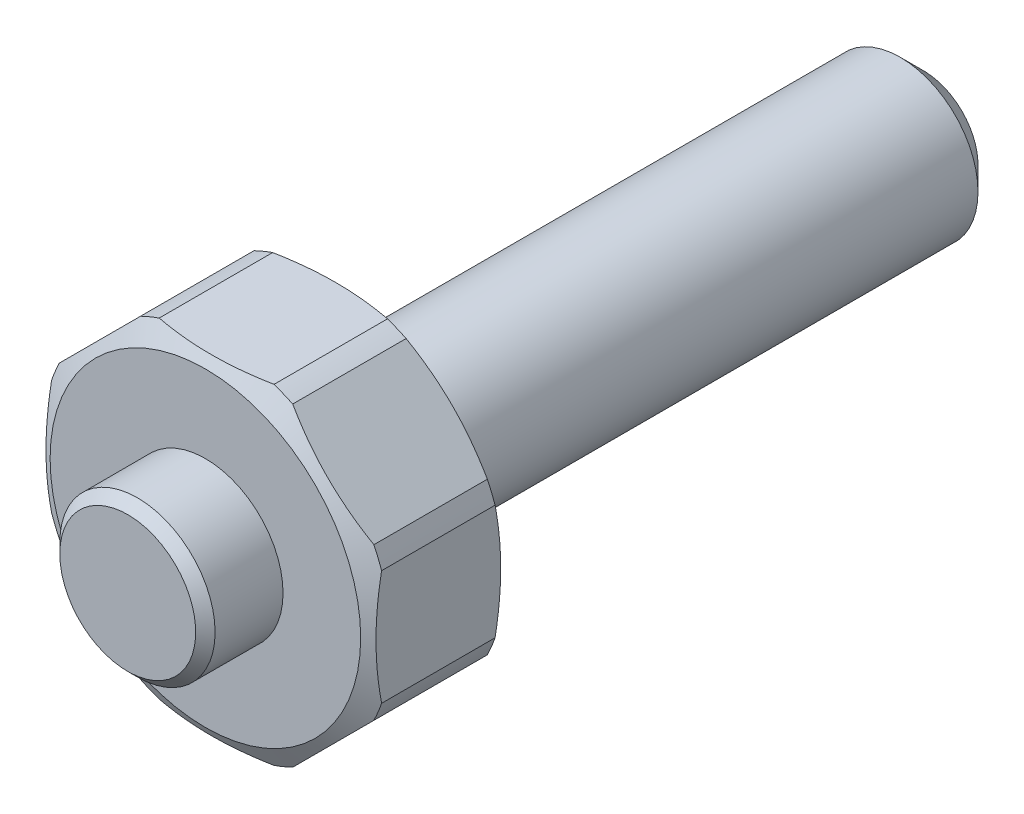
ISO-10303-21;
HEADER;
FILE_DESCRIPTION(('STEP AP214'),'2;1');
FILE_NAME('part.step','',(''),(''),'','','');
FILE_SCHEMA(('AUTOMOTIVE_DESIGN { 1 0 10303 214 1 1 1 1 }'));
ENDSEC;
DATA;
#1=APPLICATION_CONTEXT('core data for automotive mechanical design processes');
#2=APPLICATION_PROTOCOL_DEFINITION('international standard','automotive_design',2000,#1);
#3=PRODUCT_CONTEXT('',#1,'mechanical');
#4=PRODUCT('Part','Part','',(#3));
#5=PRODUCT_RELATED_PRODUCT_CATEGORY('part','',(#4));
#6=PRODUCT_DEFINITION_FORMATION('','',#4);
#7=PRODUCT_DEFINITION_CONTEXT('part definition',#1,'design');
#8=PRODUCT_DEFINITION('design','',#6,#7);
#9=PRODUCT_DEFINITION_SHAPE('','',#8);
#10=(LENGTH_UNIT() NAMED_UNIT(*) SI_UNIT(.MILLI.,.METRE.));
#11=(NAMED_UNIT(*) PLANE_ANGLE_UNIT() SI_UNIT($,.RADIAN.));
#12=(NAMED_UNIT(*) SI_UNIT($,.STERADIAN.) SOLID_ANGLE_UNIT());
#13=UNCERTAINTY_MEASURE_WITH_UNIT(LENGTH_MEASURE(1.E-05),#10,'distance_accuracy_value','');
#14=(GEOMETRIC_REPRESENTATION_CONTEXT(3) GLOBAL_UNCERTAINTY_ASSIGNED_CONTEXT((#13)) GLOBAL_UNIT_ASSIGNED_CONTEXT((#10,
#11,#12)) REPRESENTATION_CONTEXT('',''));
#15=CARTESIAN_POINT('',(0.,0.,0.));
#16=DIRECTION('',(0.,0.,1.));
#17=DIRECTION('',(1.,0.,0.));
#18=AXIS2_PLACEMENT_3D('',#15,#16,#17);
#19=CARTESIAN_POINT('',(0.,0.,40.));
#20=DIRECTION('',(0.,0.,1.));
#21=DIRECTION('',(1.,0.,0.));
#22=AXIS2_PLACEMENT_3D('',#19,#20,#21);
#23=CYLINDRICAL_SURFACE('',#22,4.);
#24=CARTESIAN_POINT('',(0.,0.,-28.8));
#25=DIRECTION('',(0.,0.,-1.));
#26=DIRECTION('',(-1.,0.,0.));
#27=AXIS2_PLACEMENT_3D('',#24,#25,#26);
#28=CIRCLE('',#27,4.);
#29=CARTESIAN_POINT('',(-4.,0.,-28.8));
#30=VERTEX_POINT('',#29);
#31=EDGE_CURVE('E9',#30,#30,#28,.F.);
#32=ORIENTED_EDGE('',*,*,#31,.T.);
#33=EDGE_LOOP('',(#32));
#34=FACE_BOUND('',#33,.T.);
#35=CARTESIAN_POINT('',(0.,0.,0.));
#36=DIRECTION('',(0.,0.,1.));
#37=DIRECTION('',(1.,0.,0.));
#38=AXIS2_PLACEMENT_3D('',#35,#36,#37);
#39=CIRCLE('',#38,4.);
#40=CARTESIAN_POINT('',(4.,0.,0.));
#41=VERTEX_POINT('',#40);
#42=EDGE_CURVE('E298',#41,#41,#39,.T.);
#43=ORIENTED_EDGE('',*,*,#42,.F.);
#44=EDGE_LOOP('',(#43));
#45=FACE_BOUND('',#44,.T.);
#46=ADVANCED_FACE('F14',(#34,#45),#23,.T.);
#47=CARTESIAN_POINT('',(4.,0.,0.));
#48=DIRECTION('',(0.,0.,1.));
#49=DIRECTION('',(1.,0.,0.));
#50=AXIS2_PLACEMENT_3D('',#47,#48,#49);
#51=PLANE('',#50);
#52=ORIENTED_EDGE('',*,*,#42,.T.);
#53=EDGE_LOOP('',(#52));
#54=FACE_BOUND('',#53,.T.);
#55=CARTESIAN_POINT('',(0.,0.,0.));
#56=DIRECTION('',(0.,0.,-1.));
#57=DIRECTION('',(-1.,0.,0.));
#58=AXIS2_PLACEMENT_3D('',#55,#56,#57);
#59=CIRCLE('',#58,8.);
#60=CARTESIAN_POINT('',(-8.,0.,0.));
#61=VERTEX_POINT('',#60);
#62=EDGE_CURVE('E403',#61,#61,#59,.T.);
#63=ORIENTED_EDGE('',*,*,#62,.T.);
#64=EDGE_LOOP('',(#63));
#65=FACE_BOUND('',#64,.T.);
#66=ADVANCED_FACE('F366',(#54,#65),#51,.F.);
#67=CARTESIAN_POINT('',(0.,0.,-40.));
#68=DIRECTION('',(0.,0.,-1.));
#69=DIRECTION('',(-1.,0.,0.));
#70=AXIS2_PLACEMENT_3D('',#67,#68,#69);
#71=CYLINDRICAL_SURFACE('',#70,9.);
#72=CARTESIAN_POINT('',(0.,0.,6.4226497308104));
#73=DIRECTION('',(0.,0.,-1.));
#74=DIRECTION('',(-1.,0.,0.));
#75=AXIS2_PLACEMENT_3D('',#72,#73,#74);
#76=CIRCLE('',#75,9.);
#77=CARTESIAN_POINT('',(3.91875757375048,-8.10205770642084,6.4226497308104));
#78=VERTEX_POINT('',#77);
#79=CARTESIAN_POINT('',(2.95803989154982,-8.5,6.4226497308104));
#80=VERTEX_POINT('',#79);
#81=EDGE_CURVE('E434',#78,#80,#76,.T.);
#82=ORIENTED_EDGE('',*,*,#81,.T.);
#83=DIRECTION('',(0.,0.,-1.));
#84=VECTOR('',#83,1.);
#85=CARTESIAN_POINT('',(2.95803989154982,-8.5,-40.));
#86=LINE('',#85,#84);
#87=CARTESIAN_POINT('',(2.95803989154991,-8.5,0.57735026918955));
#88=VERTEX_POINT('',#87);
#89=EDGE_CURVE('E476',#80,#88,#86,.T.);
#90=ORIENTED_EDGE('',*,*,#89,.T.);
#91=CARTESIAN_POINT('',(0.,0.,0.577350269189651));
#92=DIRECTION('',(0.,0.,1.));
#93=DIRECTION('',(1.,0.,0.));
#94=AXIS2_PLACEMENT_3D('',#91,#92,#93);
#95=CIRCLE('',#94,9.);
#96=CARTESIAN_POINT('',(3.91875757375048,-8.10205770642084,0.577350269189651));
#97=VERTEX_POINT('',#96);
#98=EDGE_CURVE('E410',#88,#97,#95,.T.);
#99=ORIENTED_EDGE('',*,*,#98,.T.);
#100=DIRECTION('',(0.,0.,-1.));
#101=VECTOR('',#100,1.);
#102=CARTESIAN_POINT('',(3.91875757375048,-8.10205770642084,-40.));
#103=LINE('',#102,#101);
#104=EDGE_CURVE('E292',#78,#97,#103,.T.);
#105=ORIENTED_EDGE('',*,*,#104,.F.);
#106=EDGE_LOOP('',(#82,#90,#99,#105));
#107=FACE_BOUND('',#106,.T.);
#108=ADVANCED_FACE('F373',(#107),#71,.T.);
#109=CARTESIAN_POINT('',(8.10205770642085,-3.91875757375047,0.577350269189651));
#110=VERTEX_POINT('',#109);
#111=CARTESIAN_POINT('',(8.5,-2.95803989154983,0.577350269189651));
#112=VERTEX_POINT('',#111);
#113=EDGE_CURVE('E29',#110,#112,#95,.T.);
#114=ORIENTED_EDGE('',*,*,#113,.T.);
#115=DIRECTION('',(0.,0.,-1.));
#116=VECTOR('',#115,1.);
#117=CARTESIAN_POINT('',(8.5,-2.95803989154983,-40.));
#118=LINE('',#117,#116);
#119=CARTESIAN_POINT('',(8.5,-2.95803989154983,6.4226497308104));
#120=VERTEX_POINT('',#119);
#121=EDGE_CURVE('E286',#120,#112,#118,.T.);
#122=ORIENTED_EDGE('',*,*,#121,.F.);
#123=CARTESIAN_POINT('',(8.10205770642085,-3.91875757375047,6.4226497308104));
#124=VERTEX_POINT('',#123);
#125=EDGE_CURVE('E438',#120,#124,#76,.T.);
#126=ORIENTED_EDGE('',*,*,#125,.T.);
#127=DIRECTION('',(0.,0.,-1.));
#128=VECTOR('',#127,1.);
#129=CARTESIAN_POINT('',(8.10205770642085,-3.91875757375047,-40.));
#130=LINE('',#129,#128);
#131=EDGE_CURVE('E289',#110,#124,#130,.F.);
#132=ORIENTED_EDGE('',*,*,#131,.F.);
#133=EDGE_LOOP('',(#114,#122,#126,#132));
#134=FACE_BOUND('',#133,.T.);
#135=ADVANCED_FACE('F456',(#134),#71,.T.);
#136=CARTESIAN_POINT('',(8.5,2.95803989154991,0.57735026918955));
#137=VERTEX_POINT('',#136);
#138=CARTESIAN_POINT('',(8.10205770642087,3.91875757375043,0.577350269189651));
#139=VERTEX_POINT('',#138);
#140=EDGE_CURVE('E35',#137,#139,#95,.T.);
#141=ORIENTED_EDGE('',*,*,#140,.T.);
#142=DIRECTION('',(0.,0.,-1.));
#143=VECTOR('',#142,1.);
#144=CARTESIAN_POINT('',(8.10205770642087,3.91875757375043,-40.));
#145=LINE('',#144,#143);
#146=CARTESIAN_POINT('',(8.10205770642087,3.91875757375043,6.4226497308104));
#147=VERTEX_POINT('',#146);
#148=EDGE_CURVE('E280',#147,#139,#145,.T.);
#149=ORIENTED_EDGE('',*,*,#148,.F.);
#150=CARTESIAN_POINT('',(8.5,2.95803989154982,6.4226497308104));
#151=VERTEX_POINT('',#150);
#152=EDGE_CURVE('E442',#147,#151,#76,.T.);
#153=ORIENTED_EDGE('',*,*,#152,.T.);
#154=DIRECTION('',(0.,0.,-1.));
#155=VECTOR('',#154,1.);
#156=CARTESIAN_POINT('',(8.5,2.95803989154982,-40.));
#157=LINE('',#156,#155);
#158=EDGE_CURVE('E283',#137,#151,#157,.F.);
#159=ORIENTED_EDGE('',*,*,#158,.F.);
#160=EDGE_LOOP('',(#141,#149,#153,#159));
#161=FACE_BOUND('',#160,.T.);
#162=ADVANCED_FACE('F453',(#161),#71,.T.);
#163=CARTESIAN_POINT('',(3.91875757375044,8.10205770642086,0.577350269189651));
#164=VERTEX_POINT('',#163);
#165=CARTESIAN_POINT('',(2.95803989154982,8.5,0.577350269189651));
#166=VERTEX_POINT('',#165);
#167=EDGE_CURVE('E406',#164,#166,#95,.T.);
#168=ORIENTED_EDGE('',*,*,#167,.T.);
#169=DIRECTION('',(0.,0.,-1.));
#170=VECTOR('',#169,1.);
#171=CARTESIAN_POINT('',(2.95803989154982,8.5,-40.));
#172=LINE('',#171,#170);
#173=CARTESIAN_POINT('',(2.95803989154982,8.5,6.4226497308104));
#174=VERTEX_POINT('',#173);
#175=EDGE_CURVE('E274',#174,#166,#172,.T.);
#176=ORIENTED_EDGE('',*,*,#175,.F.);
#177=CARTESIAN_POINT('',(3.91875757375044,8.10205770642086,6.4226497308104));
#178=VERTEX_POINT('',#177);
#179=EDGE_CURVE('E445',#174,#178,#76,.T.);
#180=ORIENTED_EDGE('',*,*,#179,.T.);
#181=DIRECTION('',(0.,0.,-1.));
#182=VECTOR('',#181,1.);
#183=CARTESIAN_POINT('',(3.91875757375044,8.10205770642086,-40.));
#184=LINE('',#183,#182);
#185=EDGE_CURVE('E277',#164,#178,#184,.F.);
#186=ORIENTED_EDGE('',*,*,#185,.F.);
#187=EDGE_LOOP('',(#168,#176,#180,#186));
#188=FACE_BOUND('',#187,.T.);
#189=ADVANCED_FACE('F463',(#188),#71,.T.);
#190=CARTESIAN_POINT('',(-2.95803989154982,8.5,0.577350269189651));
#191=VERTEX_POINT('',#190);
#192=CARTESIAN_POINT('',(-3.91875757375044,8.10205770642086,0.577350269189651));
#193=VERTEX_POINT('',#192);
#194=EDGE_CURVE('E409',#191,#193,#95,.T.);
#195=ORIENTED_EDGE('',*,*,#194,.T.);
#196=DIRECTION('',(0.,0.,-1.));
#197=VECTOR('',#196,1.);
#198=CARTESIAN_POINT('',(-3.91875757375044,8.10205770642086,-40.));
#199=LINE('',#198,#197);
#200=CARTESIAN_POINT('',(-3.91875757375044,8.10205770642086,6.4226497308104));
#201=VERTEX_POINT('',#200);
#202=EDGE_CURVE('E268',#201,#193,#199,.T.);
#203=ORIENTED_EDGE('',*,*,#202,.F.);
#204=CARTESIAN_POINT('',(-2.95803989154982,8.5,6.4226497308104));
#205=VERTEX_POINT('',#204);
#206=EDGE_CURVE('E150',#201,#205,#76,.T.);
#207=ORIENTED_EDGE('',*,*,#206,.T.);
#208=DIRECTION('',(0.,0.,-1.));
#209=VECTOR('',#208,1.);
#210=CARTESIAN_POINT('',(-2.95803989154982,8.5,-40.));
#211=LINE('',#210,#209);
#212=EDGE_CURVE('E271',#191,#205,#211,.F.);
#213=ORIENTED_EDGE('',*,*,#212,.F.);
#214=EDGE_LOOP('',(#195,#203,#207,#213));
#215=FACE_BOUND('',#214,.T.);
#216=ADVANCED_FACE('F426',(#215),#71,.T.);
#217=DIRECTION('',(0.,0.,-1.));
#218=VECTOR('',#217,1.);
#219=CARTESIAN_POINT('',(-8.5,-2.95803989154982,-40.));
#220=LINE('',#219,#218);
#221=CARTESIAN_POINT('',(-8.5,-2.95803989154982,6.4226497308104));
#222=VERTEX_POINT('',#221);
#223=CARTESIAN_POINT('',(-8.5,-2.95803989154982,0.577350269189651));
#224=VERTEX_POINT('',#223);
#225=EDGE_CURVE('E137',#222,#224,#220,.T.);
#226=ORIENTED_EDGE('',*,*,#225,.T.);
#227=CARTESIAN_POINT('',(-8.10205770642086,-3.91875757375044,0.577350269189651));
#228=VERTEX_POINT('',#227);
#229=EDGE_CURVE('E417',#224,#228,#95,.T.);
#230=ORIENTED_EDGE('',*,*,#229,.T.);
#231=DIRECTION('',(0.,0.,-1.));
#232=VECTOR('',#231,1.);
#233=CARTESIAN_POINT('',(-8.10205770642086,-3.91875757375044,-40.));
#234=LINE('',#233,#232);
#235=CARTESIAN_POINT('',(-8.10205770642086,-3.91875757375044,6.4226497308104));
#236=VERTEX_POINT('',#235);
#237=EDGE_CURVE('E261',#228,#236,#234,.F.);
#238=ORIENTED_EDGE('',*,*,#237,.T.);
#239=EDGE_CURVE('E152',#236,#222,#76,.T.);
#240=ORIENTED_EDGE('',*,*,#239,.T.);
#241=EDGE_LOOP('',(#226,#230,#238,#240));
#242=FACE_BOUND('',#241,.T.);
#243=ADVANCED_FACE('F431',(#242),#71,.T.);
#244=CARTESIAN_POINT('',(-8.10205770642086,3.91875757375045,0.577350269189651));
#245=VERTEX_POINT('',#244);
#246=CARTESIAN_POINT('',(-8.5,2.95803989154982,0.577350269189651));
#247=VERTEX_POINT('',#246);
#248=EDGE_CURVE('E133',#245,#247,#95,.T.);
#249=ORIENTED_EDGE('',*,*,#248,.T.);
#250=DIRECTION('',(0.,0.,-1.));
#251=VECTOR('',#250,1.);
#252=CARTESIAN_POINT('',(-8.5,2.95803989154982,-40.));
#253=LINE('',#252,#251);
#254=CARTESIAN_POINT('',(-8.5,2.95803989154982,6.4226497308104));
#255=VERTEX_POINT('',#254);
#256=EDGE_CURVE('E127',#247,#255,#253,.F.);
#257=ORIENTED_EDGE('',*,*,#256,.T.);
#258=CARTESIAN_POINT('',(-8.10205770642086,3.91875757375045,6.4226497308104));
#259=VERTEX_POINT('',#258);
#260=EDGE_CURVE('E131',#255,#259,#76,.T.);
#261=ORIENTED_EDGE('',*,*,#260,.T.);
#262=DIRECTION('',(0.,0.,-1.));
#263=VECTOR('',#262,1.);
#264=CARTESIAN_POINT('',(-8.10205770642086,3.91875757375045,-40.));
#265=LINE('',#264,#263);
#266=EDGE_CURVE('E266',#245,#259,#265,.F.);
#267=ORIENTED_EDGE('',*,*,#266,.F.);
#268=EDGE_LOOP('',(#249,#257,#261,#267));
#269=FACE_BOUND('',#268,.T.);
#270=ADVANCED_FACE('F129',(#269),#71,.T.);
#271=DIRECTION('',(0.,0.,-1.));
#272=VECTOR('',#271,1.);
#273=CARTESIAN_POINT('',(-3.91875757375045,-8.10205770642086,-40.));
#274=LINE('',#273,#272);
#275=CARTESIAN_POINT('',(-3.91875757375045,-8.10205770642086,6.4226497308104));
#276=VERTEX_POINT('',#275);
#277=CARTESIAN_POINT('',(-3.91875757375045,-8.10205770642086,0.577350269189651));
#278=VERTEX_POINT('',#277);
#279=EDGE_CURVE('E138',#276,#278,#274,.T.);
#280=ORIENTED_EDGE('',*,*,#279,.T.);
#281=CARTESIAN_POINT('',(-2.95803989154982,-8.5,0.577350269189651));
#282=VERTEX_POINT('',#281);
#283=EDGE_CURVE('E413',#278,#282,#95,.T.);
#284=ORIENTED_EDGE('',*,*,#283,.T.);
#285=DIRECTION('',(0.,0.,-1.));
#286=VECTOR('',#285,1.);
#287=CARTESIAN_POINT('',(-2.95803989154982,-8.5,-40.));
#288=LINE('',#287,#286);
#289=CARTESIAN_POINT('',(-2.95803989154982,-8.5,6.4226497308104));
#290=VERTEX_POINT('',#289);
#291=EDGE_CURVE('E314',#282,#290,#288,.F.);
#292=ORIENTED_EDGE('',*,*,#291,.T.);
#293=EDGE_CURVE('E432',#290,#276,#76,.T.);
#294=ORIENTED_EDGE('',*,*,#293,.T.);
#295=EDGE_LOOP('',(#280,#284,#292,#294));
#296=FACE_BOUND('',#295,.T.);
#297=ADVANCED_FACE('F464',(#296),#71,.T.);
#298=CARTESIAN_POINT('',(0.,0.,1.7223750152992));
#299=DIRECTION('',(0.,0.,1.));
#300=DIRECTION('',(1.,0.,0.));
#301=AXIS2_PLACEMENT_3D('',#298,#299,#300);
#302=CONICAL_SURFACE('',#301,10.9832410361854,1.0471975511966);
#303=CARTESIAN_POINT('',(8.10280285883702,-3.9180124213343,0.577550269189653));
#304=CARTESIAN_POINT('',(7.95991753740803,-4.06089774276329,0.539178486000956));
#305=CARTESIAN_POINT('',(7.81656017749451,-4.2042551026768,0.504212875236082));
#306=CARTESIAN_POINT('',(7.5290154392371,-4.49179984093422,0.441634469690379));
#307=CARTESIAN_POINT('',(7.38482788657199,-4.63598739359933,0.414023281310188));
#308=CARTESIAN_POINT('',(7.09575516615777,-4.92506011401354,0.366704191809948));
#309=CARTESIAN_POINT('',(6.95086979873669,-5.06994548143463,0.346998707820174));
#310=CARTESIAN_POINT('',(6.66066283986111,-5.36015244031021,0.315914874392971));
#311=CARTESIAN_POINT('',(6.51534128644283,-5.50547399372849,0.304535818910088));
#312=CARTESIAN_POINT('',(6.22660931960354,-5.79420596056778,0.290459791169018));
#313=CARTESIAN_POINT('',(6.08320194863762,-5.9376133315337,0.287638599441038));
#314=CARTESIAN_POINT('',(5.79642742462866,-6.22438785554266,0.290388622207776));
#315=CARTESIAN_POINT('',(5.65306027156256,-6.36775500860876,0.295959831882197));
#316=CARTESIAN_POINT('',(5.36668609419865,-6.65412918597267,0.315366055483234));
#317=CARTESIAN_POINT('',(5.22367891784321,-6.79713636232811,0.329196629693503));
#318=CARTESIAN_POINT('',(4.93817600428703,-7.08263927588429,0.364823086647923));
#319=CARTESIAN_POINT('',(4.79568021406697,-7.22513506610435,0.386618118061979));
#320=CARTESIAN_POINT('',(4.59205039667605,-7.42876488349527,0.423230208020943));
#321=CARTESIAN_POINT('',(4.53063343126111,-7.49018184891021,0.434988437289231));
#322=CARTESIAN_POINT('',(4.40794459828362,-7.6128706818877,0.459869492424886));
#323=CARTESIAN_POINT('',(4.34667271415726,-7.67414256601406,0.472992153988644));
#324=CARTESIAN_POINT('',(4.22407870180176,-7.79673657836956,0.500604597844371));
#325=CARTESIAN_POINT('',(4.16275706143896,-7.85805821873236,0.515098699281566));
#326=CARTESIAN_POINT('',(4.04026659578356,-7.98054868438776,0.545372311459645));
#327=CARTESIAN_POINT('',(3.97909778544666,-8.04171749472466,0.561151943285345));
#328=CARTESIAN_POINT('',(3.91801242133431,-8.10280285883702,0.577550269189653));
#329=B_SPLINE_CURVE_WITH_KNOTS('',3,(#303,#304,#305,#306,#307,#308,#309,#310,#311,#312,#313,
#314,#315,#316,#317,#318,#319,#320,#321,#322,#323,#324,#325,#326,#327,#328),.UNSPECIFIED.,.F.,
.F.,(4,2,2,2,2,2,2,2,2,2,2,2,4),(0.,0.617045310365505,1.23422528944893,1.8515938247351,
2.46891000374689,3.07722174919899,3.68553314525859,4.29351784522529,4.90143757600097,
5.16437645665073,5.42728371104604,5.69104841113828,5.95483798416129),.UNSPECIFIED.);
#330=EDGE_CURVE('E249',#110,#97,#329,.T.);
#331=ORIENTED_EDGE('',*,*,#330,.T.);
#332=ORIENTED_EDGE('',*,*,#98,.F.);
#333=CARTESIAN_POINT('',(-10.6070347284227,-8.5,3.228897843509));
#334=CARTESIAN_POINT('',(-10.284692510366,-8.5,3.0837183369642));
#335=CARTESIAN_POINT('',(-9.96139755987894,-8.5,2.94060656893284));
#336=CARTESIAN_POINT('',(-9.31246034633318,-8.5,2.65959666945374));
#337=CARTESIAN_POINT('',(-8.98681753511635,-8.5,2.52169980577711));
#338=CARTESIAN_POINT('',(-8.33095650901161,-8.5,2.25146909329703));
#339=CARTESIAN_POINT('',(-8.00072260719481,-8.5,2.11917314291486));
#340=CARTESIAN_POINT('',(-7.33718521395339,-8.5,1.86254447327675));
#341=CARTESIAN_POINT('',(-7.00388192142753,-8.5,1.73821124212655));
#342=CARTESIAN_POINT('',(-6.33722971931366,-8.5,1.50063229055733));
#343=CARTESIAN_POINT('',(-6.00391734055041,-8.5,1.38728470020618));
#344=CARTESIAN_POINT('',(-5.33341965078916,-8.5,1.17250067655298));
#345=CARTESIAN_POINT('',(-4.99623405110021,-8.5,1.07106513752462));
#346=CARTESIAN_POINT('',(-4.31850077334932,-8.5,0.883057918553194));
#347=CARTESIAN_POINT('',(-3.97796219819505,-8.5,0.796453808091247));
#348=CARTESIAN_POINT('',(-3.29292622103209,-8.5,0.640925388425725));
#349=CARTESIAN_POINT('',(-2.94842980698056,-8.5,0.571996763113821));
#350=CARTESIAN_POINT('',(-2.2044356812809,-8.5,0.446287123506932));
#351=CARTESIAN_POINT('',(-1.80435585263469,-8.5,0.392822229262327));
#352=CARTESIAN_POINT('',(-1.20205535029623,-8.5,0.336178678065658));
#353=CARTESIAN_POINT('',(-1.00089583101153,-8.5,0.321222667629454));
#354=CARTESIAN_POINT('',(-0.598123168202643,-8.5,0.299449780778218));
#355=CARTESIAN_POINT('',(-0.396510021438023,-8.5,0.292632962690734));
#356=CARTESIAN_POINT('',(0.00699907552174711,-8.5,0.287293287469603));
#357=CARTESIAN_POINT('',(0.208895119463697,-8.5,0.288777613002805));
#358=CARTESIAN_POINT('',(0.612453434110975,-8.5,0.300021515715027));
#359=CARTESIAN_POINT('',(0.814115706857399,-8.5,0.309781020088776));
#360=CARTESIAN_POINT('',(1.21682155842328,-8.5,0.337362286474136));
#361=CARTESIAN_POINT('',(1.41786531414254,-8.5,0.355181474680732));
#362=CARTESIAN_POINT('',(1.81912904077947,-8.5,0.398512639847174));
#363=CARTESIAN_POINT('',(2.01934893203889,-8.5,0.424025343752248));
#364=CARTESIAN_POINT('',(2.63799122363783,-8.5,0.514257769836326));
#365=CARTESIAN_POINT('',(3.05465650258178,-8.5,0.591271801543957));
#366=CARTESIAN_POINT('',(3.8822482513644,-8.5,0.771762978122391));
#367=CARTESIAN_POINT('',(4.29317189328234,-8.5,0.875252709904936));
#368=CARTESIAN_POINT('',(5.11065144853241,-8.5,1.10367678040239));
#369=CARTESIAN_POINT('',(5.51718437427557,-8.5,1.22869236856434));
#370=CARTESIAN_POINT('',(6.3246959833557,-8.5,1.49517104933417));
#371=CARTESIAN_POINT('',(6.72567542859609,-8.5,1.63663186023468));
#372=CARTESIAN_POINT('',(7.52776878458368,-8.5,1.9341030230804));
#373=CARTESIAN_POINT('',(7.92882391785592,-8.5,2.09027066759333));
#374=CARTESIAN_POINT('',(8.7268608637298,-8.5,2.41271981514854));
#375=CARTESIAN_POINT('',(9.12384233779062,-8.5,2.57900215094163));
#376=CARTESIAN_POINT('',(9.91056361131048,-8.5,2.91780454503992));
#377=CARTESIAN_POINT('',(10.3003363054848,-8.5,3.09024850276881));
#378=CARTESIAN_POINT('',(10.8828523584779,-8.5,3.35348170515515));
#379=CARTESIAN_POINT('',(11.0766392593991,-8.5,3.44197415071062));
#380=CARTESIAN_POINT('',(11.4635756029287,-8.5,3.62033244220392));
#381=CARTESIAN_POINT('',(11.6567250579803,-8.5,3.7101982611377));
#382=CARTESIAN_POINT('',(11.8495884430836,-8.5,3.80067420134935));
#383=B_SPLINE_CURVE_WITH_KNOTS('',3,(#333,#334,#335,#336,#337,#338,#339,#340,#341,#342,#343,
#344,#345,#346,#347,#348,#349,#350,#351,#352,#353,#354,#355,#356,#357,#358,#359,#360,#361,#362,
#363,#364,#365,#366,#367,#368,#369,#370,#371,#372,#373,#374,#375,#376,#377,#378,#379,#380,#381,
#382),.UNSPECIFIED.,.F.,.F.,(4,2,2,2,2,2,2,2,2,2,2,2,2,2,2,2,2,2,2,2,2,2,2,2,4),(0.,
1.06060399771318,2.12146419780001,3.18862423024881,4.25571558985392,5.31170823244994,
6.36778010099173,7.42151242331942,8.47498719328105,9.68464991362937,10.2896561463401,
10.8946667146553,11.5002008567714,12.1057296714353,12.7110652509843,13.3164580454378,
14.586456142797,15.8570591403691,17.1325676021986,18.4078993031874,19.6988870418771,
20.9899812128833,22.2685587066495,22.9076620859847,23.5467529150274),.UNSPECIFIED.);
#384=EDGE_CURVE('E307',#282,#88,#383,.T.);
#385=ORIENTED_EDGE('',*,*,#384,.F.);
#386=ORIENTED_EDGE('',*,*,#283,.F.);
#387=CARTESIAN_POINT('',(-8.10280285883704,-3.91801242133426,0.577550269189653));
#388=CARTESIAN_POINT('',(-7.95991753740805,-4.06089774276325,0.539178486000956));
#389=CARTESIAN_POINT('',(-7.81656017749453,-4.20425510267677,0.504212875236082));
#390=CARTESIAN_POINT('',(-7.52901543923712,-4.49179984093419,0.441634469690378));
#391=CARTESIAN_POINT('',(-7.38482788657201,-4.63598739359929,0.414023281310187));
#392=CARTESIAN_POINT('',(-7.09575516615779,-4.92506011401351,0.366704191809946));
#393=CARTESIAN_POINT('',(-6.95086979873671,-5.06994548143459,0.346998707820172));
#394=CARTESIAN_POINT('',(-6.66066283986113,-5.36015244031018,0.315914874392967));
#395=CARTESIAN_POINT('',(-6.51534128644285,-5.50547399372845,0.304535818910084));
#396=CARTESIAN_POINT('',(-6.22660931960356,-5.79420596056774,0.290459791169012));
#397=CARTESIAN_POINT('',(-6.08320194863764,-5.93761333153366,0.287638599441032));
#398=CARTESIAN_POINT('',(-5.79642742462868,-6.22438785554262,0.29038862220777));
#399=CARTESIAN_POINT('',(-5.65306027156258,-6.36775500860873,0.295959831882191));
#400=CARTESIAN_POINT('',(-5.36668609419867,-6.65412918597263,0.315366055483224));
#401=CARTESIAN_POINT('',(-5.22367891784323,-6.79713636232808,0.32919662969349));
#402=CARTESIAN_POINT('',(-4.93817600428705,-7.08263927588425,0.364823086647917));
#403=CARTESIAN_POINT('',(-4.79568021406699,-7.22513506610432,0.386618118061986));
#404=CARTESIAN_POINT('',(-4.59205039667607,-7.42876488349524,0.423230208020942));
#405=CARTESIAN_POINT('',(-4.53063343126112,-7.49018184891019,0.434988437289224));
#406=CARTESIAN_POINT('',(-4.40794459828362,-7.61287068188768,0.459869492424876));
#407=CARTESIAN_POINT('',(-4.34667271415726,-7.67414256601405,0.472992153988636));
#408=CARTESIAN_POINT('',(-4.22407870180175,-7.79673657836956,0.500604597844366));
#409=CARTESIAN_POINT('',(-4.16275706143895,-7.85805821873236,0.515098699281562));
#410=CARTESIAN_POINT('',(-4.04026659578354,-7.98054868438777,0.545372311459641));
#411=CARTESIAN_POINT('',(-3.97909778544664,-8.04171749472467,0.561151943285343));
#412=CARTESIAN_POINT('',(-3.91801242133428,-8.10280285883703,0.577550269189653));
#413=B_SPLINE_CURVE_WITH_KNOTS('',3,(#387,#388,#389,#390,#391,#392,#393,#394,#395,#396,#397,
#398,#399,#400,#401,#402,#403,#404,#405,#406,#407,#408,#409,#410,#411,#412),.UNSPECIFIED.,.F.,
.F.,(4,2,2,2,2,2,2,2,2,2,2,2,4),(0.,0.617045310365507,1.23422528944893,1.8515938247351,
2.46891000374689,3.07722174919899,3.68553314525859,4.29351784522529,4.90143757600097,
5.16437645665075,5.42728371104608,5.69104841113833,5.95483798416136),.UNSPECIFIED.);
#414=EDGE_CURVE('E325',#228,#278,#413,.T.);
#415=ORIENTED_EDGE('',*,*,#414,.F.);
#416=ORIENTED_EDGE('',*,*,#229,.F.);
#417=CARTESIAN_POINT('',(-8.5,-10.6070347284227,3.228897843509));
#418=CARTESIAN_POINT('',(-8.5,-10.284692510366,3.0837183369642));
#419=CARTESIAN_POINT('',(-8.5,-9.96139755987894,2.94060656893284));
#420=CARTESIAN_POINT('',(-8.5,-9.31246034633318,2.65959666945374));
#421=CARTESIAN_POINT('',(-8.5,-8.98681753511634,2.52169980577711));
#422=CARTESIAN_POINT('',(-8.5,-8.3309565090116,2.25146909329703));
#423=CARTESIAN_POINT('',(-8.5,-8.0007226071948,2.11917314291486));
#424=CARTESIAN_POINT('',(-8.5,-7.33718521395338,1.86254447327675));
#425=CARTESIAN_POINT('',(-8.5,-7.00388192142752,1.73821124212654));
#426=CARTESIAN_POINT('',(-8.5,-6.33722971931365,1.50063229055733));
#427=CARTESIAN_POINT('',(-8.5,-6.0039173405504,1.38728470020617));
#428=CARTESIAN_POINT('',(-8.5,-5.33341965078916,1.17250067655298));
#429=CARTESIAN_POINT('',(-8.5,-4.99623405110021,1.07106513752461));
#430=CARTESIAN_POINT('',(-8.5,-4.31850077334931,0.883057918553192));
#431=CARTESIAN_POINT('',(-8.5,-3.97796219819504,0.796453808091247));
#432=CARTESIAN_POINT('',(-8.5,-3.29292622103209,0.640925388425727));
#433=CARTESIAN_POINT('',(-8.5,-2.94842980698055,0.571996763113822));
#434=CARTESIAN_POINT('',(-8.5,-2.2044356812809,0.446287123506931));
#435=CARTESIAN_POINT('',(-8.5,-1.80435585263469,0.392822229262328));
#436=CARTESIAN_POINT('',(-8.5,-1.20205535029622,0.336178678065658));
#437=CARTESIAN_POINT('',(-8.5,-1.00089583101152,0.321222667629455));
#438=CARTESIAN_POINT('',(-8.5,-0.598123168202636,0.299449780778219));
#439=CARTESIAN_POINT('',(-8.5,-0.396510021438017,0.292632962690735));
#440=CARTESIAN_POINT('',(-8.5,0.00699907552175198,0.287293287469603));
#441=CARTESIAN_POINT('',(-8.5,0.208895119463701,0.288777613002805));
#442=CARTESIAN_POINT('',(-8.5,0.612453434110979,0.300021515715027));
#443=CARTESIAN_POINT('',(-8.5,0.814115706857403,0.309781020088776));
#444=CARTESIAN_POINT('',(-8.5,1.21682155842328,0.337362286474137));
#445=CARTESIAN_POINT('',(-8.5,1.41786531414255,0.355181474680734));
#446=CARTESIAN_POINT('',(-8.5,1.81912904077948,0.398512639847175));
#447=CARTESIAN_POINT('',(-8.5,2.01934893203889,0.424025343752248));
#448=CARTESIAN_POINT('',(-8.5,2.63799122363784,0.514257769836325));
#449=CARTESIAN_POINT('',(-8.5,3.05465650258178,0.591271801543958));
#450=CARTESIAN_POINT('',(-8.5,3.88224825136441,0.771762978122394));
#451=CARTESIAN_POINT('',(-8.5,4.29317189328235,0.875252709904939));
#452=CARTESIAN_POINT('',(-8.5,5.11065144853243,1.10367678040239));
#453=CARTESIAN_POINT('',(-8.5,5.51718437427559,1.22869236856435));
#454=CARTESIAN_POINT('',(-8.5,6.32469598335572,1.49517104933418));
#455=CARTESIAN_POINT('',(-8.5,6.72567542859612,1.63663186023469));
#456=CARTESIAN_POINT('',(-8.5,7.5277687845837,1.93410302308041));
#457=CARTESIAN_POINT('',(-8.5,7.92882391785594,2.09027066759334));
#458=CARTESIAN_POINT('',(-8.5,8.72686086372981,2.41271981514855));
#459=CARTESIAN_POINT('',(-8.5,9.12384233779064,2.57900215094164));
#460=CARTESIAN_POINT('',(-8.5,9.9105636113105,2.91780454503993));
#461=CARTESIAN_POINT('',(-8.5,10.3003363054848,3.09024850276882));
#462=CARTESIAN_POINT('',(-8.5,10.8828523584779,3.35348170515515));
#463=CARTESIAN_POINT('',(-8.5,11.0766392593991,3.44197415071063));
#464=CARTESIAN_POINT('',(-8.5,11.4635756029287,3.62033244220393));
#465=CARTESIAN_POINT('',(-8.5,11.6567250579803,3.7101982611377));
#466=CARTESIAN_POINT('',(-8.5,11.8495884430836,3.80067420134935));
#467=B_SPLINE_CURVE_WITH_KNOTS('',3,(#417,#418,#419,#420,#421,#422,#423,#424,#425,#426,#427,
#428,#429,#430,#431,#432,#433,#434,#435,#436,#437,#438,#439,#440,#441,#442,#443,#444,#445,#446,
#447,#448,#449,#450,#451,#452,#453,#454,#455,#456,#457,#458,#459,#460,#461,#462,#463,#464,#465,
#466),.UNSPECIFIED.,.F.,.F.,(4,2,2,2,2,2,2,2,2,2,2,2,2,2,2,2,2,2,2,2,2,2,2,2,4),(0.,
1.06060399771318,2.12146419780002,3.18862423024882,4.25571558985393,5.31170823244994,
6.36778010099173,7.42151242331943,8.47498719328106,9.68464991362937,10.2896561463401,
10.8946667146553,11.5002008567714,12.1057296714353,12.7110652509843,13.3164580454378,
14.586456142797,15.8570591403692,17.1325676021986,18.4078993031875,19.6988870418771,
20.9899812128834,22.2685587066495,22.9076620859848,23.5467529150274),.UNSPECIFIED.);
#468=EDGE_CURVE('E332',#247,#224,#467,.F.);
#469=ORIENTED_EDGE('',*,*,#468,.F.);
#470=ORIENTED_EDGE('',*,*,#248,.F.);
#471=CARTESIAN_POINT('',(-8.10280285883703,3.91801242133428,0.577550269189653));
#472=CARTESIAN_POINT('',(-7.95991753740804,4.06089774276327,0.539178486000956));
#473=CARTESIAN_POINT('',(-7.81656017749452,4.20425510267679,0.504212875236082));
#474=CARTESIAN_POINT('',(-7.5290154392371,4.4917998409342,0.441634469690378));
#475=CARTESIAN_POINT('',(-7.384827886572,4.63598739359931,0.414023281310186));
#476=CARTESIAN_POINT('',(-7.09575516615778,4.92506011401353,0.366704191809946));
#477=CARTESIAN_POINT('',(-6.9508697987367,5.06994548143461,0.346998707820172));
#478=CARTESIAN_POINT('',(-6.66066283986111,5.3601524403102,0.315914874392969));
#479=CARTESIAN_POINT('',(-6.51534128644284,5.50547399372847,0.304535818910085));
#480=CARTESIAN_POINT('',(-6.22660931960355,5.79420596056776,0.290459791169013));
#481=CARTESIAN_POINT('',(-6.08320194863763,5.93761333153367,0.287638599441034));
#482=CARTESIAN_POINT('',(-5.79642742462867,6.22438785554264,0.290388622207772));
#483=CARTESIAN_POINT('',(-5.65306027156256,6.36775500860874,0.295959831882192));
#484=CARTESIAN_POINT('',(-5.36668609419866,6.65412918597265,0.315366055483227));
#485=CARTESIAN_POINT('',(-5.22367891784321,6.79713636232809,0.329196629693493));
#486=CARTESIAN_POINT('',(-4.93817600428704,7.08263927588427,0.364823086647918));
#487=CARTESIAN_POINT('',(-4.79568021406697,7.22513506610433,0.386618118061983));
#488=CARTESIAN_POINT('',(-4.59205039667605,7.42876488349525,0.423230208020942));
#489=CARTESIAN_POINT('',(-4.53063343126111,7.4901818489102,0.434988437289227));
#490=CARTESIAN_POINT('',(-4.40794459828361,7.61287068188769,0.45986949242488));
#491=CARTESIAN_POINT('',(-4.34667271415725,7.67414256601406,0.472992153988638));
#492=CARTESIAN_POINT('',(-4.22407870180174,7.79673657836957,0.500604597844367));
#493=CARTESIAN_POINT('',(-4.16275706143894,7.85805821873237,0.515098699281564));
#494=CARTESIAN_POINT('',(-4.04026659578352,7.98054868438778,0.545372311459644));
#495=CARTESIAN_POINT('',(-3.97909778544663,8.04171749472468,0.561151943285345));
#496=CARTESIAN_POINT('',(-3.91801242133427,8.10280285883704,0.577550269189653));
#497=B_SPLINE_CURVE_WITH_KNOTS('',3,(#471,#472,#473,#474,#475,#476,#477,#478,#479,#480,#481,
#482,#483,#484,#485,#486,#487,#488,#489,#490,#491,#492,#493,#494,#495,#496),.UNSPECIFIED.,.F.,
.F.,(4,2,2,2,2,2,2,2,2,2,2,2,4),(0.,0.617045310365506,1.23422528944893,1.85159382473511,
2.46891000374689,3.07722174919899,3.68553314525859,4.2935178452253,4.90143757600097,
5.16437645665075,5.42728371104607,5.69104841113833,5.95483798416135),.UNSPECIFIED.);
#498=EDGE_CURVE('E338',#245,#193,#497,.T.);
#499=ORIENTED_EDGE('',*,*,#498,.T.);
#500=ORIENTED_EDGE('',*,*,#194,.F.);
#501=CARTESIAN_POINT('',(-10.6070347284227,8.5,3.228897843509));
#502=CARTESIAN_POINT('',(-10.284692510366,8.5,3.0837183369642));
#503=CARTESIAN_POINT('',(-9.96139755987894,8.5,2.94060656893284));
#504=CARTESIAN_POINT('',(-9.31246034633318,8.5,2.65959666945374));
#505=CARTESIAN_POINT('',(-8.98681753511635,8.5,2.52169980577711));
#506=CARTESIAN_POINT('',(-8.33095650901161,8.5,2.25146909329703));
#507=CARTESIAN_POINT('',(-8.00072260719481,8.5,2.11917314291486));
#508=CARTESIAN_POINT('',(-7.33718521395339,8.5,1.86254447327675));
#509=CARTESIAN_POINT('',(-7.00388192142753,8.5,1.73821124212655));
#510=CARTESIAN_POINT('',(-6.33722971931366,8.5,1.50063229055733));
#511=CARTESIAN_POINT('',(-6.00391734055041,8.5,1.38728470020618));
#512=CARTESIAN_POINT('',(-5.33341965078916,8.5,1.17250067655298));
#513=CARTESIAN_POINT('',(-4.99623405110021,8.5,1.07106513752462));
#514=CARTESIAN_POINT('',(-4.31850077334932,8.5,0.883057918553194));
#515=CARTESIAN_POINT('',(-3.97796219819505,8.5,0.796453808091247));
#516=CARTESIAN_POINT('',(-3.29292622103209,8.5,0.640925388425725));
#517=CARTESIAN_POINT('',(-2.94842980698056,8.5,0.571996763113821));
#518=CARTESIAN_POINT('',(-2.2044356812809,8.5,0.446287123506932));
#519=CARTESIAN_POINT('',(-1.80435585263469,8.5,0.392822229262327));
#520=CARTESIAN_POINT('',(-1.20205535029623,8.5,0.336178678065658));
#521=CARTESIAN_POINT('',(-1.00089583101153,8.5,0.321222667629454));
#522=CARTESIAN_POINT('',(-0.598123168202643,8.5,0.299449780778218));
#523=CARTESIAN_POINT('',(-0.396510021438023,8.5,0.292632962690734));
#524=CARTESIAN_POINT('',(0.00699907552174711,8.5,0.287293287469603));
#525=CARTESIAN_POINT('',(0.208895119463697,8.5,0.288777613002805));
#526=CARTESIAN_POINT('',(0.612453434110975,8.5,0.300021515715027));
#527=CARTESIAN_POINT('',(0.814115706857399,8.5,0.309781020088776));
#528=CARTESIAN_POINT('',(1.21682155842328,8.5,0.337362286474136));
#529=CARTESIAN_POINT('',(1.41786531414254,8.5,0.355181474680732));
#530=CARTESIAN_POINT('',(1.81912904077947,8.5,0.398512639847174));
#531=CARTESIAN_POINT('',(2.01934893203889,8.5,0.424025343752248));
#532=CARTESIAN_POINT('',(2.63799122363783,8.5,0.514257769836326));
#533=CARTESIAN_POINT('',(3.05465650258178,8.5,0.591271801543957));
#534=CARTESIAN_POINT('',(3.8822482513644,8.5,0.771762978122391));
#535=CARTESIAN_POINT('',(4.29317189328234,8.5,0.875252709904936));
#536=CARTESIAN_POINT('',(5.11065144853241,8.5,1.10367678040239));
#537=CARTESIAN_POINT('',(5.51718437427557,8.5,1.22869236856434));
#538=CARTESIAN_POINT('',(6.3246959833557,8.5,1.49517104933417));
#539=CARTESIAN_POINT('',(6.72567542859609,8.5,1.63663186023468));
#540=CARTESIAN_POINT('',(7.52776878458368,8.5,1.9341030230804));
#541=CARTESIAN_POINT('',(7.92882391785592,8.5,2.09027066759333));
#542=CARTESIAN_POINT('',(8.7268608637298,8.5,2.41271981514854));
#543=CARTESIAN_POINT('',(9.12384233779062,8.5,2.57900215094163));
#544=CARTESIAN_POINT('',(9.91056361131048,8.5,2.91780454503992));
#545=CARTESIAN_POINT('',(10.3003363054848,8.5,3.09024850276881));
#546=CARTESIAN_POINT('',(10.8828523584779,8.5,3.35348170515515));
#547=CARTESIAN_POINT('',(11.0766392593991,8.5,3.44197415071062));
#548=CARTESIAN_POINT('',(11.4635756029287,8.5,3.62033244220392));
#549=CARTESIAN_POINT('',(11.6567250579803,8.5,3.7101982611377));
#550=CARTESIAN_POINT('',(11.8495884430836,8.5,3.80067420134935));
#551=B_SPLINE_CURVE_WITH_KNOTS('',3,(#501,#502,#503,#504,#505,#506,#507,#508,#509,#510,#511,
#512,#513,#514,#515,#516,#517,#518,#519,#520,#521,#522,#523,#524,#525,#526,#527,#528,#529,#530,
#531,#532,#533,#534,#535,#536,#537,#538,#539,#540,#541,#542,#543,#544,#545,#546,#547,#548,#549,
#550),.UNSPECIFIED.,.F.,.F.,(4,2,2,2,2,2,2,2,2,2,2,2,2,2,2,2,2,2,2,2,2,2,2,2,4),(0.,
1.06060399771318,2.12146419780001,3.18862423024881,4.25571558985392,5.31170823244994,
6.36778010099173,7.42151242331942,8.47498719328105,9.68464991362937,10.2896561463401,
10.8946667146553,11.5002008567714,12.1057296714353,12.7110652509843,13.3164580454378,
14.586456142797,15.8570591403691,17.1325676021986,18.4078993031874,19.6988870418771,
20.9899812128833,22.2685587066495,22.9076620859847,23.5467529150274),.UNSPECIFIED.);
#552=EDGE_CURVE('E343',#191,#166,#551,.T.);
#553=ORIENTED_EDGE('',*,*,#552,.T.);
#554=ORIENTED_EDGE('',*,*,#167,.F.);
#555=CARTESIAN_POINT('',(3.91801242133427,8.10280285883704,0.577550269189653));
#556=CARTESIAN_POINT('',(4.06089774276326,7.95991753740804,0.539178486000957));
#557=CARTESIAN_POINT('',(4.20425510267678,7.81656017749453,0.504212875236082));
#558=CARTESIAN_POINT('',(4.49179984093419,7.52901543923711,0.441634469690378));
#559=CARTESIAN_POINT('',(4.6359873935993,7.38482788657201,0.414023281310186));
#560=CARTESIAN_POINT('',(4.92506011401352,7.09575516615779,0.366704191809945));
#561=CARTESIAN_POINT('',(5.0699454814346,6.9508697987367,0.346998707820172));
#562=CARTESIAN_POINT('',(5.36015244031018,6.66066283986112,0.315914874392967));
#563=CARTESIAN_POINT('',(5.50547399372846,6.51534128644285,0.304535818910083));
#564=CARTESIAN_POINT('',(5.79420596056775,6.22660931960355,0.290459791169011));
#565=CARTESIAN_POINT('',(5.93761333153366,6.08320194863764,0.287638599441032));
#566=CARTESIAN_POINT('',(6.22438785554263,5.79642742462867,0.290388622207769));
#567=CARTESIAN_POINT('',(6.36775500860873,5.65306027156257,0.29595983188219));
#568=CARTESIAN_POINT('',(6.65412918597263,5.36668609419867,0.315366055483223));
#569=CARTESIAN_POINT('',(6.79713636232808,5.22367891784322,0.329196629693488));
#570=CARTESIAN_POINT('',(7.08263927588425,4.93817600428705,0.364823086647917));
#571=CARTESIAN_POINT('',(7.22513506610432,4.79568021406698,0.386618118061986));
#572=CARTESIAN_POINT('',(7.42876488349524,4.59205039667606,0.423230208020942));
#573=CARTESIAN_POINT('',(7.49018184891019,4.53063343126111,0.434988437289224));
#574=CARTESIAN_POINT('',(7.61287068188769,4.40794459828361,0.459869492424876));
#575=CARTESIAN_POINT('',(7.67414256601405,4.34667271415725,0.472992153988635));
#576=CARTESIAN_POINT('',(7.79673657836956,4.22407870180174,0.500604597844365));
#577=CARTESIAN_POINT('',(7.85805821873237,4.16275706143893,0.515098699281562));
#578=CARTESIAN_POINT('',(7.98054868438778,4.04026659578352,0.545372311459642));
#579=CARTESIAN_POINT('',(8.04171749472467,3.97909778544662,0.561151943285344));
#580=CARTESIAN_POINT('',(8.10280285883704,3.91801242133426,0.577550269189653));
#581=B_SPLINE_CURVE_WITH_KNOTS('',3,(#555,#556,#557,#558,#559,#560,#561,#562,#563,#564,#565,
#566,#567,#568,#569,#570,#571,#572,#573,#574,#575,#576,#577,#578,#579,#580),.UNSPECIFIED.,.F.,
.F.,(4,2,2,2,2,2,2,2,2,2,2,2,4),(0.,0.617045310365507,1.23422528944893,1.85159382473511,
2.46891000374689,3.07722174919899,3.68553314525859,4.29351784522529,4.90143757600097,
5.16437645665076,5.42728371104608,5.69104841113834,5.95483798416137),.UNSPECIFIED.);
#582=EDGE_CURVE('E250',#164,#139,#581,.T.);
#583=ORIENTED_EDGE('',*,*,#582,.T.);
#584=ORIENTED_EDGE('',*,*,#140,.F.);
#585=CARTESIAN_POINT('',(8.5,-10.6070347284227,3.228897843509));
#586=CARTESIAN_POINT('',(8.49999999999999,-10.284692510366,3.0837183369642));
#587=CARTESIAN_POINT('',(8.49999999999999,-9.96139755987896,2.94060656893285));
#588=CARTESIAN_POINT('',(8.49999999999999,-9.31246034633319,2.65959666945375));
#589=CARTESIAN_POINT('',(8.49999999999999,-8.98681753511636,2.52169980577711));
#590=CARTESIAN_POINT('',(8.49999999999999,-8.33095650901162,2.25146909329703));
#591=CARTESIAN_POINT('',(8.49999999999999,-8.00072260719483,2.11917314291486));
#592=CARTESIAN_POINT('',(8.49999999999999,-7.33718521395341,1.86254447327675));
#593=CARTESIAN_POINT('',(8.49999999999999,-7.00388192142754,1.73821124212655));
#594=CARTESIAN_POINT('',(8.49999999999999,-6.33722971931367,1.50063229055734));
#595=CARTESIAN_POINT('',(8.49999999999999,-6.00391734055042,1.38728470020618));
#596=CARTESIAN_POINT('',(8.49999999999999,-5.33341965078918,1.17250067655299));
#597=CARTESIAN_POINT('',(8.5,-4.99623405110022,1.07106513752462));
#598=CARTESIAN_POINT('',(8.5,-4.31850077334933,0.883057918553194));
#599=CARTESIAN_POINT('',(8.5,-3.97796219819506,0.796453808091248));
#600=CARTESIAN_POINT('',(8.5,-3.2929262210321,0.640925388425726));
#601=CARTESIAN_POINT('',(8.5,-2.94842980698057,0.571996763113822));
#602=CARTESIAN_POINT('',(8.5,-2.20443568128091,0.446287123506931));
#603=CARTESIAN_POINT('',(8.5,-1.8043558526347,0.392822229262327));
#604=CARTESIAN_POINT('',(8.5,-1.20205535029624,0.336178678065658));
#605=CARTESIAN_POINT('',(8.5,-1.00089583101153,0.321222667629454));
#606=CARTESIAN_POINT('',(8.5,-0.598123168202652,0.299449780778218));
#607=CARTESIAN_POINT('',(8.5,-0.396510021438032,0.292632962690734));
#608=CARTESIAN_POINT('',(8.5,0.00699907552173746,0.287293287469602));
#609=CARTESIAN_POINT('',(8.5,0.208895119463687,0.288777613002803));
#610=CARTESIAN_POINT('',(8.5,0.612453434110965,0.300021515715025));
#611=CARTESIAN_POINT('',(8.5,0.814115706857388,0.309781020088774));
#612=CARTESIAN_POINT('',(8.5,1.21682155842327,0.337362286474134));
#613=CARTESIAN_POINT('',(8.5,1.41786531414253,0.355181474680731));
#614=CARTESIAN_POINT('',(8.5,1.81912904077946,0.398512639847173));
#615=CARTESIAN_POINT('',(8.5,2.01934893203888,0.424025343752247));
#616=CARTESIAN_POINT('',(8.5,2.63799122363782,0.514257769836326));
#617=CARTESIAN_POINT('',(8.5,3.05465650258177,0.591271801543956));
#618=CARTESIAN_POINT('',(8.5,3.88224825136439,0.771762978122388));
#619=CARTESIAN_POINT('',(8.5,4.29317189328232,0.875252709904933));
#620=CARTESIAN_POINT('',(8.5,5.1106514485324,1.10367678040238));
#621=CARTESIAN_POINT('',(8.5,5.51718437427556,1.22869236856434));
#622=CARTESIAN_POINT('',(8.5,6.32469598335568,1.49517104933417));
#623=CARTESIAN_POINT('',(8.5,6.72567542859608,1.63663186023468));
#624=CARTESIAN_POINT('',(8.5,7.52776878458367,1.9341030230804));
#625=CARTESIAN_POINT('',(8.5,7.9288239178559,2.09027066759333));
#626=CARTESIAN_POINT('',(8.5,8.72686086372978,2.41271981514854));
#627=CARTESIAN_POINT('',(8.5,9.12384233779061,2.57900215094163));
#628=CARTESIAN_POINT('',(8.5,9.91056361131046,2.91780454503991));
#629=CARTESIAN_POINT('',(8.5,10.3003363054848,3.0902485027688));
#630=CARTESIAN_POINT('',(8.5,10.8828523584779,3.35348170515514));
#631=CARTESIAN_POINT('',(8.5,11.0766392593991,3.44197415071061));
#632=CARTESIAN_POINT('',(8.5,11.4635756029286,3.62033244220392));
#633=CARTESIAN_POINT('',(8.5,11.6567250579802,3.7101982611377));
#634=CARTESIAN_POINT('',(8.5,11.8495884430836,3.80067420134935));
#635=B_SPLINE_CURVE_WITH_KNOTS('',3,(#585,#586,#587,#588,#589,#590,#591,#592,#593,#594,#595,
#596,#597,#598,#599,#600,#601,#602,#603,#604,#605,#606,#607,#608,#609,#610,#611,#612,#613,#614,
#615,#616,#617,#618,#619,#620,#621,#622,#623,#624,#625,#626,#627,#628,#629,#630,#631,#632,#633,
#634),.UNSPECIFIED.,.F.,.F.,(4,2,2,2,2,2,2,2,2,2,2,2,2,2,2,2,2,2,2,2,2,2,2,2,4),(0.,
1.06060399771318,2.12146419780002,3.18862423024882,4.25571558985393,5.31170823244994,
6.36778010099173,7.42151242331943,8.47498719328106,9.68464991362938,10.2896561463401,
10.8946667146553,11.5002008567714,12.1057296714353,12.7110652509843,13.3164580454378,
14.586456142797,15.8570591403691,17.1325676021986,18.4078993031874,19.6988870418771,
20.9899812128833,22.2685587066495,22.9076620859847,23.5467529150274),.UNSPECIFIED.);
#636=EDGE_CURVE('E242',#137,#112,#635,.F.);
#637=ORIENTED_EDGE('',*,*,#636,.T.);
#638=ORIENTED_EDGE('',*,*,#113,.F.);
#639=EDGE_LOOP('',(#331,#332,#385,#386,#415,#416,#469,#470,#499,#500,#553,#554,#583,#584,#637,#638));
#640=FACE_BOUND('',#639,.T.);
#641=ORIENTED_EDGE('',*,*,#62,.F.);
#642=EDGE_LOOP('',(#641));
#643=FACE_BOUND('',#642,.T.);
#644=ADVANCED_FACE('F187',(#640,#643),#302,.T.);
#645=CARTESIAN_POINT('',(0.,0.,7.));
#646=DIRECTION('',(0.,0.,-1.));
#647=DIRECTION('',(-1.,0.,0.));
#648=AXIS2_PLACEMENT_3D('',#645,#646,#647);
#649=CONICAL_SURFACE('',#648,8.,1.0471975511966);
#650=CARTESIAN_POINT('',(3.91801242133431,-8.10280285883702,6.4224497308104));
#651=CARTESIAN_POINT('',(4.0608977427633,-7.95991753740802,6.46082151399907));
#652=CARTESIAN_POINT('',(4.20425510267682,-7.8165601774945,6.49578712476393));
#653=CARTESIAN_POINT('',(4.49179984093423,-7.52901543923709,6.55836553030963));
#654=CARTESIAN_POINT('',(4.63598739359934,-7.38482788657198,6.58597671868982));
#655=CARTESIAN_POINT('',(4.92506011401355,-7.09575516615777,6.63329580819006));
#656=CARTESIAN_POINT('',(5.06994548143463,-6.95086979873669,6.65300129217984));
#657=CARTESIAN_POINT('',(5.36015244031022,-6.6606628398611,6.68408512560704));
#658=CARTESIAN_POINT('',(5.50547399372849,-6.51534128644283,6.69546418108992));
#659=CARTESIAN_POINT('',(5.79420596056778,-6.22660931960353,6.70954020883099));
#660=CARTESIAN_POINT('',(5.9376133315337,-6.08320194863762,6.71236140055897));
#661=CARTESIAN_POINT('',(6.22438785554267,-5.79642742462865,6.70961137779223));
#662=CARTESIAN_POINT('',(6.36775500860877,-5.65306027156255,6.70404016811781));
#663=CARTESIAN_POINT('',(6.65412918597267,-5.36668609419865,6.68463394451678));
#664=CARTESIAN_POINT('',(6.79713636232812,-5.2236789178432,6.67080337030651));
#665=CARTESIAN_POINT('',(7.08263927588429,-4.93817600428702,6.63517691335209));
#666=CARTESIAN_POINT('',(7.22513506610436,-4.79568021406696,6.61338188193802));
#667=CARTESIAN_POINT('',(7.42876488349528,-4.59205039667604,6.57676979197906));
#668=CARTESIAN_POINT('',(7.49018184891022,-4.5306334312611,6.56501156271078));
#669=CARTESIAN_POINT('',(7.61287068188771,-4.40794459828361,6.54013050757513));
#670=CARTESIAN_POINT('',(7.67414256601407,-4.34667271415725,6.52700784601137));
#671=CARTESIAN_POINT('',(7.79673657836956,-4.22407870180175,6.49939540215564));
#672=CARTESIAN_POINT('',(7.85805821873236,-4.16275706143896,6.48490130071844));
#673=CARTESIAN_POINT('',(7.98054868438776,-4.04026659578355,6.45462768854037));
#674=CARTESIAN_POINT('',(8.04171749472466,-3.97909778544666,6.43884805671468));
#675=CARTESIAN_POINT('',(8.10280285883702,-3.9180124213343,6.4224497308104));
#676=B_SPLINE_CURVE_WITH_KNOTS('',3,(#650,#651,#652,#653,#654,#655,#656,#657,#658,#659,#660,
#661,#662,#663,#664,#665,#666,#667,#668,#669,#670,#671,#672,#673,#674,#675),.UNSPECIFIED.,.F.,
.F.,(4,2,2,2,2,2,2,2,2,2,2,2,4),(0.,0.617045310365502,1.23422528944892,1.85159382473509,
2.46891000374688,3.07722174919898,3.68553314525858,4.29351784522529,4.90143757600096,
5.16437645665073,5.42728371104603,5.69104841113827,5.95483798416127),.UNSPECIFIED.);
#677=EDGE_CURVE('E225',#78,#124,#676,.T.);
#678=ORIENTED_EDGE('',*,*,#677,.T.);
#679=ORIENTED_EDGE('',*,*,#125,.F.);
#680=CARTESIAN_POINT('',(8.5,-10.6070347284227,3.77110215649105));
#681=CARTESIAN_POINT('',(8.49999999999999,-10.284692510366,3.91628166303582));
#682=CARTESIAN_POINT('',(8.49999999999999,-9.96139755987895,4.05939343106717));
#683=CARTESIAN_POINT('',(8.49999999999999,-9.31246034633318,4.34040333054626));
#684=CARTESIAN_POINT('',(8.49999999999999,-8.98681753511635,4.4783001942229));
#685=CARTESIAN_POINT('',(8.49999999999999,-8.33095650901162,4.74853090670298));
#686=CARTESIAN_POINT('',(8.49999999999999,-8.00072260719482,4.88082685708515));
#687=CARTESIAN_POINT('',(8.49999999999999,-7.33718521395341,5.13745552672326));
#688=CARTESIAN_POINT('',(8.49999999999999,-7.00388192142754,5.26178875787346));
#689=CARTESIAN_POINT('',(8.49999999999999,-6.33722971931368,5.49936770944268));
#690=CARTESIAN_POINT('',(8.49999999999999,-6.00391734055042,5.61271529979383));
#691=CARTESIAN_POINT('',(8.49999999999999,-5.33341965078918,5.82749932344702));
#692=CARTESIAN_POINT('',(8.5,-4.99623405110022,5.92893486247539));
#693=CARTESIAN_POINT('',(8.5,-4.31850077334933,6.11694208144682));
#694=CARTESIAN_POINT('',(8.5,-3.97796219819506,6.20354619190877));
#695=CARTESIAN_POINT('',(8.5,-3.2929262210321,6.35907461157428));
#696=CARTESIAN_POINT('',(8.5,-2.94842980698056,6.42800323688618));
#697=CARTESIAN_POINT('',(8.5,-2.20443568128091,6.55371287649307));
#698=CARTESIAN_POINT('',(8.5,-1.8043558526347,6.60717777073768));
#699=CARTESIAN_POINT('',(8.5,-1.20205535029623,6.66382132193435));
#700=CARTESIAN_POINT('',(8.5,-1.00089583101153,6.67877733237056));
#701=CARTESIAN_POINT('',(8.5,-0.598123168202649,6.70055021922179));
#702=CARTESIAN_POINT('',(8.5,-0.396510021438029,6.70736703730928));
#703=CARTESIAN_POINT('',(8.5,0.0069990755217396,6.71270671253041));
#704=CARTESIAN_POINT('',(8.5,0.208895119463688,6.71122238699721));
#705=CARTESIAN_POINT('',(8.5,0.612453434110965,6.69997848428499));
#706=CARTESIAN_POINT('',(8.5,0.814115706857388,6.69021897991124));
#707=CARTESIAN_POINT('',(8.5,1.21682155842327,6.66263771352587));
#708=CARTESIAN_POINT('',(8.5,1.41786531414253,6.64481852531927));
#709=CARTESIAN_POINT('',(8.5,1.81912904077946,6.60148736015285));
#710=CARTESIAN_POINT('',(8.5,2.01934893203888,6.5759746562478));
#711=CARTESIAN_POINT('',(8.5,2.63799122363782,6.48574223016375));
#712=CARTESIAN_POINT('',(8.5,3.05465650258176,6.40872819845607));
#713=CARTESIAN_POINT('',(8.5,3.88224825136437,6.22823702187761));
#714=CARTESIAN_POINT('',(8.5,4.29317189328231,6.12474729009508));
#715=CARTESIAN_POINT('',(8.5,5.11065144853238,5.89632321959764));
#716=CARTESIAN_POINT('',(8.5,5.51718437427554,5.77130763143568));
#717=CARTESIAN_POINT('',(8.5,6.32469598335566,5.50482895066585));
#718=CARTESIAN_POINT('',(8.5,6.72567542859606,5.36336813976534));
#719=CARTESIAN_POINT('',(8.5,7.52776878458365,5.06589697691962));
#720=CARTESIAN_POINT('',(8.5,7.92882391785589,4.90972933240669));
#721=CARTESIAN_POINT('',(8.5,8.72686086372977,4.58728018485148));
#722=CARTESIAN_POINT('',(8.5,9.1238423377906,4.42099784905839));
#723=CARTESIAN_POINT('',(8.5,9.91056361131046,4.0821954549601));
#724=CARTESIAN_POINT('',(8.5,10.3003363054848,3.90975149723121));
#725=CARTESIAN_POINT('',(8.5,10.8828523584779,3.64651829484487));
#726=CARTESIAN_POINT('',(8.5,11.0766392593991,3.5580258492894));
#727=CARTESIAN_POINT('',(8.5,11.4635756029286,3.37966755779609));
#728=CARTESIAN_POINT('',(8.5,11.6567250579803,3.28980173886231));
#729=CARTESIAN_POINT('',(8.5,11.8495884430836,3.19932579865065));
#730=B_SPLINE_CURVE_WITH_KNOTS('',3,(#680,#681,#682,#683,#684,#685,#686,#687,#688,#689,#690,
#691,#692,#693,#694,#695,#696,#697,#698,#699,#700,#701,#702,#703,#704,#705,#706,#707,#708,#709,
#710,#711,#712,#713,#714,#715,#716,#717,#718,#719,#720,#721,#722,#723,#724,#725,#726,#727,#728,
#729),.UNSPECIFIED.,.F.,.F.,(4,2,2,2,2,2,2,2,2,2,2,2,2,2,2,2,2,2,2,2,2,2,2,2,4),(0.,
1.06060399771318,2.12146419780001,3.1886242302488,4.25571558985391,5.31170823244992,
6.36778010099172,7.42151242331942,8.47498719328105,9.68464991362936,10.2896561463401,
10.8946667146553,11.5002008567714,12.1057296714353,12.7110652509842,13.3164580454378,
14.586456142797,15.8570591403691,17.1325676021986,18.4078993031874,19.698887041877,
20.9899812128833,22.2685587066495,22.9076620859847,23.5467529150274),.UNSPECIFIED.);
#731=EDGE_CURVE('E219',#120,#151,#730,.T.);
#732=ORIENTED_EDGE('',*,*,#731,.T.);
#733=ORIENTED_EDGE('',*,*,#152,.F.);
#734=CARTESIAN_POINT('',(8.10280285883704,3.91801242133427,6.4224497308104));
#735=CARTESIAN_POINT('',(7.95991753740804,4.06089774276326,6.46082151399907));
#736=CARTESIAN_POINT('',(7.81656017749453,4.20425510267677,6.49578712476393));
#737=CARTESIAN_POINT('',(7.52901543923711,4.49179984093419,6.55836553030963));
#738=CARTESIAN_POINT('',(7.384827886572,4.63598739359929,6.58597671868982));
#739=CARTESIAN_POINT('',(7.09575516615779,4.92506011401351,6.63329580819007));
#740=CARTESIAN_POINT('',(6.95086979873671,5.06994548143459,6.65300129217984));
#741=CARTESIAN_POINT('',(6.66066283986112,5.36015244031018,6.68408512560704));
#742=CARTESIAN_POINT('',(6.51534128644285,5.50547399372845,6.69546418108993));
#743=CARTESIAN_POINT('',(6.22660931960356,5.79420596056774,6.709540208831));
#744=CARTESIAN_POINT('',(6.08320194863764,5.93761333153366,6.71236140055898));
#745=CARTESIAN_POINT('',(5.79642742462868,6.22438785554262,6.70961137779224));
#746=CARTESIAN_POINT('',(5.65306027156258,6.36775500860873,6.70404016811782));
#747=CARTESIAN_POINT('',(5.36668609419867,6.65412918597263,6.68463394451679));
#748=CARTESIAN_POINT('',(5.22367891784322,6.79713636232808,6.67080337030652));
#749=CARTESIAN_POINT('',(4.93817600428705,7.08263927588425,6.63517691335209));
#750=CARTESIAN_POINT('',(4.79568021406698,7.22513506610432,6.61338188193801));
#751=CARTESIAN_POINT('',(4.59205039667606,7.42876488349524,6.57676979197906));
#752=CARTESIAN_POINT('',(4.53063343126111,7.49018184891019,6.56501156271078));
#753=CARTESIAN_POINT('',(4.40794459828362,7.61287068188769,6.54013050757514));
#754=CARTESIAN_POINT('',(4.34667271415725,7.67414256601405,6.52700784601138));
#755=CARTESIAN_POINT('',(4.22407870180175,7.79673657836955,6.49939540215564));
#756=CARTESIAN_POINT('',(4.16275706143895,7.85805821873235,6.48490130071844));
#757=CARTESIAN_POINT('',(4.04026659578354,7.98054868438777,6.45462768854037));
#758=CARTESIAN_POINT('',(3.97909778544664,8.04171749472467,6.43884805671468));
#759=CARTESIAN_POINT('',(3.91801242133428,8.10280285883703,6.4224497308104));
#760=B_SPLINE_CURVE_WITH_KNOTS('',3,(#734,#735,#736,#737,#738,#739,#740,#741,#742,#743,#744,
#745,#746,#747,#748,#749,#750,#751,#752,#753,#754,#755,#756,#757,#758,#759),.UNSPECIFIED.,.F.,
.F.,(4,2,2,2,2,2,2,2,2,2,2,2,4),(0.,0.617045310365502,1.23422528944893,1.85159382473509,
2.46891000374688,3.07722174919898,3.68553314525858,4.29351784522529,4.90143757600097,
5.16437645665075,5.42728371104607,5.69104841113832,5.95483798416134),.UNSPECIFIED.);
#761=EDGE_CURVE('E212',#147,#178,#760,.T.);
#762=ORIENTED_EDGE('',*,*,#761,.T.);
#763=ORIENTED_EDGE('',*,*,#179,.F.);
#764=CARTESIAN_POINT('',(-10.6070347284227,8.5,3.77110215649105));
#765=CARTESIAN_POINT('',(-10.284692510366,8.5,3.91628166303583));
#766=CARTESIAN_POINT('',(-9.96139755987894,8.5,4.05939343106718));
#767=CARTESIAN_POINT('',(-9.31246034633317,8.5,4.34040333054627));
#768=CARTESIAN_POINT('',(-8.98681753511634,8.5,4.4783001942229));
#769=CARTESIAN_POINT('',(-8.33095650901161,8.5,4.74853090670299));
#770=CARTESIAN_POINT('',(-8.00072260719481,8.5,4.88082685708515));
#771=CARTESIAN_POINT('',(-7.33718521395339,8.5,5.13745552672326));
#772=CARTESIAN_POINT('',(-7.00388192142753,8.5,5.26178875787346));
#773=CARTESIAN_POINT('',(-6.33722971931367,8.5,5.49936770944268));
#774=CARTESIAN_POINT('',(-6.00391734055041,8.5,5.61271529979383));
#775=CARTESIAN_POINT('',(-5.33341965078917,8.5,5.82749932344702));
#776=CARTESIAN_POINT('',(-4.99623405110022,8.5,5.92893486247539));
#777=CARTESIAN_POINT('',(-4.31850077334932,8.5,6.11694208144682));
#778=CARTESIAN_POINT('',(-3.97796219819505,8.5,6.20354619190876));
#779=CARTESIAN_POINT('',(-3.2929262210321,8.5,6.35907461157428));
#780=CARTESIAN_POINT('',(-2.94842980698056,8.5,6.42800323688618));
#781=CARTESIAN_POINT('',(-2.2044356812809,8.5,6.55371287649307));
#782=CARTESIAN_POINT('',(-1.80435585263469,8.5,6.60717777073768));
#783=CARTESIAN_POINT('',(-1.20205535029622,8.5,6.66382132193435));
#784=CARTESIAN_POINT('',(-1.00089583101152,8.5,6.67877733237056));
#785=CARTESIAN_POINT('',(-0.59812316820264,8.5,6.70055021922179));
#786=CARTESIAN_POINT('',(-0.39651002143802,8.5,6.70736703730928));
#787=CARTESIAN_POINT('',(0.00699907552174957,8.5,6.71270671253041));
#788=CARTESIAN_POINT('',(0.208895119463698,8.5,6.7112223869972));
#789=CARTESIAN_POINT('',(0.612453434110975,8.5,6.69997848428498));
#790=CARTESIAN_POINT('',(0.814115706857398,8.5,6.69021897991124));
#791=CARTESIAN_POINT('',(1.21682155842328,8.5,6.66263771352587));
#792=CARTESIAN_POINT('',(1.41786531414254,8.5,6.64481852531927));
#793=CARTESIAN_POINT('',(1.81912904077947,8.5,6.60148736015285));
#794=CARTESIAN_POINT('',(2.01934893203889,8.5,6.5759746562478));
#795=CARTESIAN_POINT('',(2.63799122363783,8.5,6.48574223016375));
#796=CARTESIAN_POINT('',(3.05465650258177,8.5,6.40872819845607));
#797=CARTESIAN_POINT('',(3.88224825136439,8.5,6.22823702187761));
#798=CARTESIAN_POINT('',(4.29317189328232,8.5,6.12474729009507));
#799=CARTESIAN_POINT('',(5.1106514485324,8.5,5.89632321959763));
#800=CARTESIAN_POINT('',(5.51718437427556,8.5,5.77130763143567));
#801=CARTESIAN_POINT('',(6.32469598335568,8.5,5.50482895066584));
#802=CARTESIAN_POINT('',(6.72567542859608,8.5,5.36336813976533));
#803=CARTESIAN_POINT('',(7.52776878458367,8.5,5.06589697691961));
#804=CARTESIAN_POINT('',(7.92882391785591,8.5,4.90972933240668));
#805=CARTESIAN_POINT('',(8.7268608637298,8.5,4.58728018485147));
#806=CARTESIAN_POINT('',(9.12384233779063,8.5,4.42099784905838));
#807=CARTESIAN_POINT('',(9.91056361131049,8.5,4.08219545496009));
#808=CARTESIAN_POINT('',(10.3003363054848,8.5,3.90975149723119));
#809=CARTESIAN_POINT('',(10.8828523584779,8.5,3.64651829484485));
#810=CARTESIAN_POINT('',(11.0766392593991,8.5,3.55802584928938));
#811=CARTESIAN_POINT('',(11.4635756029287,8.5,3.37966755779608));
#812=CARTESIAN_POINT('',(11.6567250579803,8.5,3.2898017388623));
#813=CARTESIAN_POINT('',(11.8495884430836,8.5,3.19932579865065));
#814=B_SPLINE_CURVE_WITH_KNOTS('',3,(#764,#765,#766,#767,#768,#769,#770,#771,#772,#773,#774,
#775,#776,#777,#778,#779,#780,#781,#782,#783,#784,#785,#786,#787,#788,#789,#790,#791,#792,#793,
#794,#795,#796,#797,#798,#799,#800,#801,#802,#803,#804,#805,#806,#807,#808,#809,#810,#811,#812,
#813),.UNSPECIFIED.,.F.,.F.,(4,2,2,2,2,2,2,2,2,2,2,2,2,2,2,2,2,2,2,2,2,2,2,2,4),(0.,
1.06060399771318,2.1214641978,3.1886242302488,4.2557155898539,5.31170823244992,6.36778010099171,
7.4215124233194,8.47498719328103,9.68464991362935,10.2896561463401,10.8946667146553,
11.5002008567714,12.1057296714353,12.7110652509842,13.3164580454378,14.586456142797,
15.8570591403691,17.1325676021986,18.4078993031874,19.698887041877,20.9899812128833,
22.2685587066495,22.9076620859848,23.5467529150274),.UNSPECIFIED.);
#815=EDGE_CURVE('E158',#174,#205,#814,.F.);
#816=ORIENTED_EDGE('',*,*,#815,.T.);
#817=ORIENTED_EDGE('',*,*,#206,.F.);
#818=CARTESIAN_POINT('',(-3.91801242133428,8.10280285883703,6.4224497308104));
#819=CARTESIAN_POINT('',(-4.06089774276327,7.95991753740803,6.46082151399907));
#820=CARTESIAN_POINT('',(-4.20425510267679,7.81656017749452,6.49578712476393));
#821=CARTESIAN_POINT('',(-4.4917998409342,7.5290154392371,6.55836553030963));
#822=CARTESIAN_POINT('',(-4.63598739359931,7.384827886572,6.58597671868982));
#823=CARTESIAN_POINT('',(-4.92506011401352,7.09575516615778,6.63329580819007));
#824=CARTESIAN_POINT('',(-5.0699454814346,6.9508697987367,6.65300129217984));
#825=CARTESIAN_POINT('',(-5.36015244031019,6.66066283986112,6.68408512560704));
#826=CARTESIAN_POINT('',(-5.50547399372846,6.51534128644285,6.69546418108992));
#827=CARTESIAN_POINT('',(-5.79420596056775,6.22660931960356,6.709540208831));
#828=CARTESIAN_POINT('',(-5.93761333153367,6.08320194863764,6.71236140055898));
#829=CARTESIAN_POINT('',(-6.22438785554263,5.79642742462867,6.70961137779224));
#830=CARTESIAN_POINT('',(-6.36775500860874,5.65306027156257,6.70404016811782));
#831=CARTESIAN_POINT('',(-6.65412918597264,5.36668609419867,6.68463394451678));
#832=CARTESIAN_POINT('',(-6.79713636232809,5.22367891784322,6.67080337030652));
#833=CARTESIAN_POINT('',(-7.08263927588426,4.93817600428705,6.63517691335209));
#834=CARTESIAN_POINT('',(-7.22513506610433,4.79568021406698,6.61338188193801));
#835=CARTESIAN_POINT('',(-7.42876488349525,4.59205039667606,6.57676979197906));
#836=CARTESIAN_POINT('',(-7.4901818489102,4.53063343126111,6.56501156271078));
#837=CARTESIAN_POINT('',(-7.61287068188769,4.40794459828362,6.54013050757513));
#838=CARTESIAN_POINT('',(-7.67414256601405,4.34667271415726,6.52700784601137));
#839=CARTESIAN_POINT('',(-7.79673657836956,4.22407870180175,6.49939540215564));
#840=CARTESIAN_POINT('',(-7.85805821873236,4.16275706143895,6.48490130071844));
#841=CARTESIAN_POINT('',(-7.98054868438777,4.04026659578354,6.45462768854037));
#842=CARTESIAN_POINT('',(-8.04171749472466,3.97909778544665,6.43884805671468));
#843=CARTESIAN_POINT('',(-8.10280285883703,3.91801242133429,6.4224497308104));
#844=B_SPLINE_CURVE_WITH_KNOTS('',3,(#818,#819,#820,#821,#822,#823,#824,#825,#826,#827,#828,
#829,#830,#831,#832,#833,#834,#835,#836,#837,#838,#839,#840,#841,#842,#843),.UNSPECIFIED.,.F.,
.F.,(4,2,2,2,2,2,2,2,2,2,2,2,4),(0.,0.617045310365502,1.23422528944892,1.85159382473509,
2.46891000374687,3.07722174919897,3.68553314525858,4.29351784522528,4.90143757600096,
5.16437645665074,5.42728371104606,5.6910484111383,5.95483798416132),.UNSPECIFIED.);
#845=EDGE_CURVE('E148',#201,#259,#844,.T.);
#846=ORIENTED_EDGE('',*,*,#845,.T.);
#847=ORIENTED_EDGE('',*,*,#260,.F.);
#848=CARTESIAN_POINT('',(-8.5,-10.6070347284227,3.77110215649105));
#849=CARTESIAN_POINT('',(-8.5,-10.284692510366,3.91628166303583));
#850=CARTESIAN_POINT('',(-8.5,-9.96139755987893,4.05939343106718));
#851=CARTESIAN_POINT('',(-8.5,-9.31246034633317,4.34040333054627));
#852=CARTESIAN_POINT('',(-8.5,-8.98681753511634,4.4783001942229));
#853=CARTESIAN_POINT('',(-8.5,-8.3309565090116,4.74853090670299));
#854=CARTESIAN_POINT('',(-8.5,-8.00072260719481,4.88082685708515));
#855=CARTESIAN_POINT('',(-8.5,-7.33718521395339,5.13745552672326));
#856=CARTESIAN_POINT('',(-8.5,-7.00388192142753,5.26178875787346));
#857=CARTESIAN_POINT('',(-8.5,-6.33722971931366,5.49936770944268));
#858=CARTESIAN_POINT('',(-8.5,-6.00391734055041,5.61271529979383));
#859=CARTESIAN_POINT('',(-8.5,-5.33341965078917,5.82749932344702));
#860=CARTESIAN_POINT('',(-8.5,-4.99623405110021,5.92893486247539));
#861=CARTESIAN_POINT('',(-8.5,-4.31850077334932,6.11694208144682));
#862=CARTESIAN_POINT('',(-8.5,-3.97796219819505,6.20354619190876));
#863=CARTESIAN_POINT('',(-8.5,-3.29292622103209,6.35907461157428));
#864=CARTESIAN_POINT('',(-8.5,-2.94842980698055,6.42800323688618));
#865=CARTESIAN_POINT('',(-8.5,-2.2044356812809,6.55371287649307));
#866=CARTESIAN_POINT('',(-8.5,-1.80435585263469,6.60717777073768));
#867=CARTESIAN_POINT('',(-8.5,-1.20205535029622,6.66382132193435));
#868=CARTESIAN_POINT('',(-8.5,-1.00089583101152,6.67877733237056));
#869=CARTESIAN_POINT('',(-8.5,-0.598123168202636,6.70055021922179));
#870=CARTESIAN_POINT('',(-8.5,-0.396510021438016,6.70736703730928));
#871=CARTESIAN_POINT('',(-8.5,0.00699907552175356,6.71270671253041));
#872=CARTESIAN_POINT('',(-8.5,0.208895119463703,6.7112223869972));
#873=CARTESIAN_POINT('',(-8.5,0.61245343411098,6.69997848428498));
#874=CARTESIAN_POINT('',(-8.5,0.814115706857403,6.69021897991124));
#875=CARTESIAN_POINT('',(-8.5,1.21682155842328,6.66263771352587));
#876=CARTESIAN_POINT('',(-8.5,1.41786531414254,6.64481852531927));
#877=CARTESIAN_POINT('',(-8.5,1.81912904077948,6.60148736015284));
#878=CARTESIAN_POINT('',(-8.5,2.01934893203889,6.5759746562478));
#879=CARTESIAN_POINT('',(-8.5,2.63799122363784,6.48574223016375));
#880=CARTESIAN_POINT('',(-8.5,3.05465650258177,6.40872819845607));
#881=CARTESIAN_POINT('',(-8.5,3.88224825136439,6.2282370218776));
#882=CARTESIAN_POINT('',(-8.5,4.29317189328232,6.12474729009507));
#883=CARTESIAN_POINT('',(-8.5,5.1106514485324,5.89632321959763));
#884=CARTESIAN_POINT('',(-8.5,5.51718437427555,5.77130763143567));
#885=CARTESIAN_POINT('',(-8.5,6.32469598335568,5.50482895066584));
#886=CARTESIAN_POINT('',(-8.5,6.72567542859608,5.36336813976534));
#887=CARTESIAN_POINT('',(-8.5,7.52776878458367,5.06589697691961));
#888=CARTESIAN_POINT('',(-8.5,7.92882391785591,4.90972933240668));
#889=CARTESIAN_POINT('',(-8.5,8.7268608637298,4.58728018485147));
#890=CARTESIAN_POINT('',(-8.5,9.12384233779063,4.42099784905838));
#891=CARTESIAN_POINT('',(-8.5,9.91056361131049,4.08219545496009));
#892=CARTESIAN_POINT('',(-8.5,10.3003363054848,3.9097514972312));
#893=CARTESIAN_POINT('',(-8.5,10.8828523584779,3.64651829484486));
#894=CARTESIAN_POINT('',(-8.5,11.0766392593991,3.55802584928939));
#895=CARTESIAN_POINT('',(-8.5,11.4635756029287,3.37966755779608));
#896=CARTESIAN_POINT('',(-8.5,11.6567250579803,3.2898017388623));
#897=CARTESIAN_POINT('',(-8.5,11.8495884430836,3.19932579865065));
#898=B_SPLINE_CURVE_WITH_KNOTS('',3,(#848,#849,#850,#851,#852,#853,#854,#855,#856,#857,#858,
#859,#860,#861,#862,#863,#864,#865,#866,#867,#868,#869,#870,#871,#872,#873,#874,#875,#876,#877,
#878,#879,#880,#881,#882,#883,#884,#885,#886,#887,#888,#889,#890,#891,#892,#893,#894,#895,#896,
#897),.UNSPECIFIED.,.F.,.F.,(4,2,2,2,2,2,2,2,2,2,2,2,2,2,2,2,2,2,2,2,2,2,2,2,4),(0.,
1.06060399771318,2.1214641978,3.1886242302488,4.2557155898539,5.31170823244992,6.36778010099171,
7.42151242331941,8.47498719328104,9.68464991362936,10.2896561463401,10.8946667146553,
11.5002008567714,12.1057296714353,12.7110652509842,13.3164580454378,14.586456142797,
15.8570591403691,17.1325676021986,18.4078993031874,19.698887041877,20.9899812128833,
22.2685587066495,22.9076620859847,23.5467529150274),.UNSPECIFIED.);
#899=EDGE_CURVE('E144',#222,#255,#898,.T.);
#900=ORIENTED_EDGE('',*,*,#899,.F.);
#901=ORIENTED_EDGE('',*,*,#239,.F.);
#902=CARTESIAN_POINT('',(-3.91801242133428,-8.10280285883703,6.4224497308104));
#903=CARTESIAN_POINT('',(-4.06089774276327,-7.95991753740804,6.46082151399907));
#904=CARTESIAN_POINT('',(-4.20425510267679,-7.81656017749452,6.49578712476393));
#905=CARTESIAN_POINT('',(-4.4917998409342,-7.5290154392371,6.55836553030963));
#906=CARTESIAN_POINT('',(-4.63598739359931,-7.384827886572,6.58597671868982));
#907=CARTESIAN_POINT('',(-4.92506011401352,-7.09575516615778,6.63329580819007));
#908=CARTESIAN_POINT('',(-5.0699454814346,-6.9508697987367,6.65300129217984));
#909=CARTESIAN_POINT('',(-5.36015244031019,-6.66066283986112,6.68408512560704));
#910=CARTESIAN_POINT('',(-5.50547399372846,-6.51534128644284,6.69546418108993));
#911=CARTESIAN_POINT('',(-5.79420596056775,-6.22660931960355,6.709540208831));
#912=CARTESIAN_POINT('',(-5.93761333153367,-6.08320194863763,6.71236140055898));
#913=CARTESIAN_POINT('',(-6.22438785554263,-5.79642742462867,6.70961137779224));
#914=CARTESIAN_POINT('',(-6.36775500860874,-5.65306027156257,6.70404016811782));
#915=CARTESIAN_POINT('',(-6.65412918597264,-5.36668609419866,6.68463394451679));
#916=CARTESIAN_POINT('',(-6.79713636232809,-5.22367891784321,6.67080337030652));
#917=CARTESIAN_POINT('',(-7.08263927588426,-4.93817600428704,6.63517691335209));
#918=CARTESIAN_POINT('',(-7.22513506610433,-4.79568021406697,6.61338188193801));
#919=CARTESIAN_POINT('',(-7.42876488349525,-4.59205039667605,6.57676979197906));
#920=CARTESIAN_POINT('',(-7.4901818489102,-4.5306334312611,6.56501156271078));
#921=CARTESIAN_POINT('',(-7.61287068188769,-4.40794459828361,6.54013050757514));
#922=CARTESIAN_POINT('',(-7.67414256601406,-4.34667271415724,6.52700784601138));
#923=CARTESIAN_POINT('',(-7.79673657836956,-4.22407870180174,6.49939540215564));
#924=CARTESIAN_POINT('',(-7.85805821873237,-4.16275706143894,6.48490130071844));
#925=CARTESIAN_POINT('',(-7.98054868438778,-4.04026659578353,6.45462768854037));
#926=CARTESIAN_POINT('',(-8.04171749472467,-3.97909778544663,6.43884805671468));
#927=CARTESIAN_POINT('',(-8.10280285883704,-3.91801242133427,6.4224497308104));
#928=B_SPLINE_CURVE_WITH_KNOTS('',3,(#902,#903,#904,#905,#906,#907,#908,#909,#910,#911,#912,
#913,#914,#915,#916,#917,#918,#919,#920,#921,#922,#923,#924,#925,#926,#927),.UNSPECIFIED.,.F.,
.F.,(4,2,2,2,2,2,2,2,2,2,2,2,4),(0.,0.617045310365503,1.23422528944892,1.85159382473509,
2.46891000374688,3.07722174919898,3.68553314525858,4.29351784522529,4.90143757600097,
5.16437645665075,5.42728371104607,5.69104841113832,5.95483798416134),.UNSPECIFIED.);
#929=EDGE_CURVE('E156',#276,#236,#928,.T.);
#930=ORIENTED_EDGE('',*,*,#929,.F.);
#931=ORIENTED_EDGE('',*,*,#293,.F.);
#932=CARTESIAN_POINT('',(-10.6070347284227,-8.5,3.77110215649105));
#933=CARTESIAN_POINT('',(-10.284692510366,-8.5,3.91628166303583));
#934=CARTESIAN_POINT('',(-9.96139755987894,-8.5,4.05939343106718));
#935=CARTESIAN_POINT('',(-9.31246034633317,-8.5,4.34040333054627));
#936=CARTESIAN_POINT('',(-8.98681753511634,-8.5,4.4783001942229));
#937=CARTESIAN_POINT('',(-8.33095650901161,-8.5,4.74853090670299));
#938=CARTESIAN_POINT('',(-8.00072260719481,-8.5,4.88082685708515));
#939=CARTESIAN_POINT('',(-7.33718521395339,-8.5,5.13745552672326));
#940=CARTESIAN_POINT('',(-7.00388192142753,-8.5,5.26178875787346));
#941=CARTESIAN_POINT('',(-6.33722971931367,-8.5,5.49936770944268));
#942=CARTESIAN_POINT('',(-6.00391734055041,-8.5,5.61271529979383));
#943=CARTESIAN_POINT('',(-5.33341965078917,-8.5,5.82749932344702));
#944=CARTESIAN_POINT('',(-4.99623405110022,-8.5,5.92893486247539));
#945=CARTESIAN_POINT('',(-4.31850077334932,-8.5,6.11694208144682));
#946=CARTESIAN_POINT('',(-3.97796219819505,-8.5,6.20354619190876));
#947=CARTESIAN_POINT('',(-3.2929262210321,-8.5,6.35907461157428));
#948=CARTESIAN_POINT('',(-2.94842980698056,-8.5,6.42800323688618));
#949=CARTESIAN_POINT('',(-2.2044356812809,-8.5,6.55371287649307));
#950=CARTESIAN_POINT('',(-1.80435585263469,-8.5,6.60717777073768));
#951=CARTESIAN_POINT('',(-1.20205535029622,-8.5,6.66382132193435));
#952=CARTESIAN_POINT('',(-1.00089583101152,-8.5,6.67877733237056));
#953=CARTESIAN_POINT('',(-0.59812316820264,-8.5,6.70055021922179));
#954=CARTESIAN_POINT('',(-0.39651002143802,-8.5,6.70736703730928));
#955=CARTESIAN_POINT('',(0.00699907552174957,-8.5,6.71270671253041));
#956=CARTESIAN_POINT('',(0.208895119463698,-8.5,6.7112223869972));
#957=CARTESIAN_POINT('',(0.612453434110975,-8.5,6.69997848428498));
#958=CARTESIAN_POINT('',(0.814115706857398,-8.5,6.69021897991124));
#959=CARTESIAN_POINT('',(1.21682155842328,-8.5,6.66263771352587));
#960=CARTESIAN_POINT('',(1.41786531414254,-8.5,6.64481852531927));
#961=CARTESIAN_POINT('',(1.81912904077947,-8.5,6.60148736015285));
#962=CARTESIAN_POINT('',(2.01934893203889,-8.5,6.5759746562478));
#963=CARTESIAN_POINT('',(2.63799122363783,-8.5,6.48574223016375));
#964=CARTESIAN_POINT('',(3.05465650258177,-8.5,6.40872819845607));
#965=CARTESIAN_POINT('',(3.88224825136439,-8.5,6.22823702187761));
#966=CARTESIAN_POINT('',(4.29317189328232,-8.5,6.12474729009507));
#967=CARTESIAN_POINT('',(5.1106514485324,-8.5,5.89632321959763));
#968=CARTESIAN_POINT('',(5.51718437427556,-8.5,5.77130763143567));
#969=CARTESIAN_POINT('',(6.32469598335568,-8.5,5.50482895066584));
#970=CARTESIAN_POINT('',(6.72567542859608,-8.5,5.36336813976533));
#971=CARTESIAN_POINT('',(7.52776878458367,-8.5,5.06589697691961));
#972=CARTESIAN_POINT('',(7.92882391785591,-8.5,4.90972933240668));
#973=CARTESIAN_POINT('',(8.7268608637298,-8.5,4.58728018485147));
#974=CARTESIAN_POINT('',(9.12384233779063,-8.5,4.42099784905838));
#975=CARTESIAN_POINT('',(9.91056361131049,-8.5,4.08219545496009));
#976=CARTESIAN_POINT('',(10.3003363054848,-8.5,3.90975149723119));
#977=CARTESIAN_POINT('',(10.8828523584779,-8.5,3.64651829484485));
#978=CARTESIAN_POINT('',(11.0766392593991,-8.5,3.55802584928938));
#979=CARTESIAN_POINT('',(11.4635756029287,-8.5,3.37966755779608));
#980=CARTESIAN_POINT('',(11.6567250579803,-8.5,3.2898017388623));
#981=CARTESIAN_POINT('',(11.8495884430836,-8.5,3.19932579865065));
#982=B_SPLINE_CURVE_WITH_KNOTS('',3,(#932,#933,#934,#935,#936,#937,#938,#939,#940,#941,#942,
#943,#944,#945,#946,#947,#948,#949,#950,#951,#952,#953,#954,#955,#956,#957,#958,#959,#960,#961,
#962,#963,#964,#965,#966,#967,#968,#969,#970,#971,#972,#973,#974,#975,#976,#977,#978,#979,#980,
#981),.UNSPECIFIED.,.F.,.F.,(4,2,2,2,2,2,2,2,2,2,2,2,2,2,2,2,2,2,2,2,2,2,2,2,4),(0.,
1.06060399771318,2.1214641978,3.1886242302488,4.2557155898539,5.31170823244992,6.36778010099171,
7.4215124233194,8.47498719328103,9.68464991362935,10.2896561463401,10.8946667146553,
11.5002008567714,12.1057296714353,12.7110652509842,13.3164580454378,14.586456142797,
15.8570591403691,17.1325676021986,18.4078993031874,19.698887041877,20.9899812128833,
22.2685587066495,22.9076620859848,23.5467529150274),.UNSPECIFIED.);
#983=EDGE_CURVE('E161',#80,#290,#982,.F.);
#984=ORIENTED_EDGE('',*,*,#983,.F.);
#985=ORIENTED_EDGE('',*,*,#81,.F.);
#986=EDGE_LOOP('',(#678,#679,#732,#733,#762,#763,#816,#817,#846,#847,#900,#901,#930,#931,#984,#985));
#987=FACE_BOUND('',#986,.T.);
#988=CARTESIAN_POINT('',(0.,0.,7.));
#989=DIRECTION('',(0.,0.,-1.));
#990=DIRECTION('',(-1.,0.,0.));
#991=AXIS2_PLACEMENT_3D('',#988,#989,#990);
#992=CIRCLE('',#991,8.);
#993=CARTESIAN_POINT('',(-8.,0.,7.));
#994=VERTEX_POINT('',#993);
#995=EDGE_CURVE('E149',#994,#994,#992,.T.);
#996=ORIENTED_EDGE('',*,*,#995,.T.);
#997=EDGE_LOOP('',(#996));
#998=FACE_BOUND('',#997,.T.);
#999=ADVANCED_FACE('F141',(#987,#998),#649,.T.);
#1000=CARTESIAN_POINT('',(-3.5208152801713,-8.5,7.));
#1001=DIRECTION('',(0.,1.,0.));
#1002=DIRECTION('',(0.,0.,1.));
#1003=AXIS2_PLACEMENT_3D('',#1000,#1001,#1002);
#1004=PLANE('',#1003);
#1005=ORIENTED_EDGE('',*,*,#89,.F.);
#1006=ORIENTED_EDGE('',*,*,#983,.T.);
#1007=ORIENTED_EDGE('',*,*,#291,.F.);
#1008=ORIENTED_EDGE('',*,*,#384,.T.);
#1009=EDGE_LOOP('',(#1005,#1006,#1007,#1008));
#1010=FACE_BOUND('',#1009,.T.);
#1011=ADVANCED_FACE('F186',(#1010),#1004,.F.);
#1012=CARTESIAN_POINT('',(-8.5,-3.5208152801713,7.));
#1013=DIRECTION('',(0.707106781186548,0.707106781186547,0.));
#1014=DIRECTION('',(-0.707106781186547,0.707106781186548,0.));
#1015=AXIS2_PLACEMENT_3D('',#1012,#1013,#1014);
#1016=PLANE('',#1015);
#1017=ORIENTED_EDGE('',*,*,#279,.F.);
#1018=ORIENTED_EDGE('',*,*,#929,.T.);
#1019=ORIENTED_EDGE('',*,*,#237,.F.);
#1020=ORIENTED_EDGE('',*,*,#414,.T.);
#1021=EDGE_LOOP('',(#1017,#1018,#1019,#1020));
#1022=FACE_BOUND('',#1021,.T.);
#1023=ADVANCED_FACE('F318',(#1022),#1016,.F.);
#1024=CARTESIAN_POINT('',(-8.5,3.52081528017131,7.));
#1025=DIRECTION('',(1.,0.,0.));
#1026=DIRECTION('',(0.,1.,0.));
#1027=AXIS2_PLACEMENT_3D('',#1024,#1025,#1026);
#1028=PLANE('',#1027);
#1029=ORIENTED_EDGE('',*,*,#225,.F.);
#1030=ORIENTED_EDGE('',*,*,#899,.T.);
#1031=ORIENTED_EDGE('',*,*,#256,.F.);
#1032=ORIENTED_EDGE('',*,*,#468,.T.);
#1033=EDGE_LOOP('',(#1029,#1030,#1031,#1032));
#1034=FACE_BOUND('',#1033,.T.);
#1035=ADVANCED_FACE('F154',(#1034),#1028,.F.);
#1036=CARTESIAN_POINT('',(-8.5,3.52081528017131,7.));
#1037=DIRECTION('',(-0.707106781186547,0.707106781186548,0.));
#1038=DIRECTION('',(-0.707106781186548,-0.707106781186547,0.));
#1039=AXIS2_PLACEMENT_3D('',#1036,#1037,#1038);
#1040=PLANE('',#1039);
#1041=ORIENTED_EDGE('',*,*,#845,.F.);
#1042=ORIENTED_EDGE('',*,*,#202,.T.);
#1043=ORIENTED_EDGE('',*,*,#498,.F.);
#1044=ORIENTED_EDGE('',*,*,#266,.T.);
#1045=EDGE_LOOP('',(#1041,#1042,#1043,#1044));
#1046=FACE_BOUND('',#1045,.T.);
#1047=ADVANCED_FACE('F348',(#1046),#1040,.T.);
#1048=CARTESIAN_POINT('',(-3.5208152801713,8.5,7.));
#1049=DIRECTION('',(0.,1.,0.));
#1050=DIRECTION('',(0.,0.,1.));
#1051=AXIS2_PLACEMENT_3D('',#1048,#1049,#1050);
#1052=PLANE('',#1051);
#1053=ORIENTED_EDGE('',*,*,#815,.F.);
#1054=ORIENTED_EDGE('',*,*,#175,.T.);
#1055=ORIENTED_EDGE('',*,*,#552,.F.);
#1056=ORIENTED_EDGE('',*,*,#212,.T.);
#1057=EDGE_LOOP('',(#1053,#1054,#1055,#1056));
#1058=FACE_BOUND('',#1057,.T.);
#1059=ADVANCED_FACE('F351',(#1058),#1052,.T.);
#1060=CARTESIAN_POINT('',(3.5208152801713,8.5,7.));
#1061=DIRECTION('',(0.707106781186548,0.707106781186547,0.));
#1062=DIRECTION('',(-0.707106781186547,0.707106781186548,0.));
#1063=AXIS2_PLACEMENT_3D('',#1060,#1061,#1062);
#1064=PLANE('',#1063);
#1065=ORIENTED_EDGE('',*,*,#761,.F.);
#1066=ORIENTED_EDGE('',*,*,#148,.T.);
#1067=ORIENTED_EDGE('',*,*,#582,.F.);
#1068=ORIENTED_EDGE('',*,*,#185,.T.);
#1069=EDGE_LOOP('',(#1065,#1066,#1067,#1068));
#1070=FACE_BOUND('',#1069,.T.);
#1071=ADVANCED_FACE('F235',(#1070),#1064,.T.);
#1072=CARTESIAN_POINT('',(8.5,3.5208152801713,7.));
#1073=DIRECTION('',(1.,0.,0.));
#1074=DIRECTION('',(0.,1.,0.));
#1075=AXIS2_PLACEMENT_3D('',#1072,#1073,#1074);
#1076=PLANE('',#1075);
#1077=ORIENTED_EDGE('',*,*,#731,.F.);
#1078=ORIENTED_EDGE('',*,*,#121,.T.);
#1079=ORIENTED_EDGE('',*,*,#636,.F.);
#1080=ORIENTED_EDGE('',*,*,#158,.T.);
#1081=EDGE_LOOP('',(#1077,#1078,#1079,#1080));
#1082=FACE_BOUND('',#1081,.T.);
#1083=ADVANCED_FACE('F231',(#1082),#1076,.T.);
#1084=CARTESIAN_POINT('',(8.5,-3.52081528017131,7.));
#1085=DIRECTION('',(0.707106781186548,-0.707106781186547,0.));
#1086=DIRECTION('',(0.707106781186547,0.707106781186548,0.));
#1087=AXIS2_PLACEMENT_3D('',#1084,#1085,#1086);
#1088=PLANE('',#1087);
#1089=ORIENTED_EDGE('',*,*,#677,.F.);
#1090=ORIENTED_EDGE('',*,*,#104,.T.);
#1091=ORIENTED_EDGE('',*,*,#330,.F.);
#1092=ORIENTED_EDGE('',*,*,#131,.T.);
#1093=EDGE_LOOP('',(#1089,#1090,#1091,#1092));
#1094=FACE_BOUND('',#1093,.T.);
#1095=ADVANCED_FACE('F190',(#1094),#1088,.T.);
#1096=CARTESIAN_POINT('',(4.,0.,11.));
#1097=DIRECTION('',(0.,0.,-1.));
#1098=DIRECTION('',(-1.,0.,0.));
#1099=AXIS2_PLACEMENT_3D('',#1096,#1097,#1098);
#1100=PLANE('',#1099);
#1101=CARTESIAN_POINT('',(0.,0.,11.));
#1102=DIRECTION('',(0.,0.,-1.));
#1103=DIRECTION('',(-1.,0.,0.));
#1104=AXIS2_PLACEMENT_3D('',#1101,#1102,#1103);
#1105=CIRCLE('',#1104,3.5);
#1106=CARTESIAN_POINT('',(-3.5,0.,11.));
#1107=VERTEX_POINT('',#1106);
#1108=EDGE_CURVE('E301',#1107,#1107,#1105,.F.);
#1109=ORIENTED_EDGE('',*,*,#1108,.T.);
#1110=EDGE_LOOP('',(#1109));
#1111=FACE_BOUND('',#1110,.T.);
#1112=ADVANCED_FACE('F238',(#1111),#1100,.F.);
#1113=CARTESIAN_POINT('',(0.,0.,11.));
#1114=DIRECTION('',(0.,0.,-1.));
#1115=DIRECTION('',(-1.,0.,0.));
#1116=AXIS2_PLACEMENT_3D('',#1113,#1114,#1115);
#1117=CONICAL_SURFACE('',#1116,3.5,0.785398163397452);
#1118=CARTESIAN_POINT('',(0.,0.,10.5));
#1119=DIRECTION('',(0.,0.,-1.));
#1120=DIRECTION('',(-1.,0.,0.));
#1121=AXIS2_PLACEMENT_3D('',#1118,#1119,#1120);
#1122=CIRCLE('',#1121,4.);
#1123=CARTESIAN_POINT('',(-4.,0.,10.5));
#1124=VERTEX_POINT('',#1123);
#1125=EDGE_CURVE('E304',#1124,#1124,#1122,.T.);
#1126=ORIENTED_EDGE('',*,*,#1125,.F.);
#1127=EDGE_LOOP('',(#1126));
#1128=FACE_BOUND('',#1127,.T.);
#1129=ORIENTED_EDGE('',*,*,#1108,.F.);
#1130=EDGE_LOOP('',(#1129));
#1131=FACE_BOUND('',#1130,.T.);
#1132=ADVANCED_FACE('F378',(#1128,#1131),#1117,.T.);
#1133=CARTESIAN_POINT('',(0.,0.,40.));
#1134=DIRECTION('',(0.,0.,1.));
#1135=DIRECTION('',(1.,0.,0.));
#1136=AXIS2_PLACEMENT_3D('',#1133,#1134,#1135);
#1137=CYLINDRICAL_SURFACE('',#1136,4.);
#1138=ORIENTED_EDGE('',*,*,#1125,.T.);
#1139=EDGE_LOOP('',(#1138));
#1140=FACE_BOUND('',#1139,.T.);
#1141=CARTESIAN_POINT('',(0.,0.,7.));
#1142=DIRECTION('',(0.,0.,1.));
#1143=DIRECTION('',(1.,0.,0.));
#1144=AXIS2_PLACEMENT_3D('',#1141,#1142,#1143);
#1145=CIRCLE('',#1144,4.);
#1146=CARTESIAN_POINT('',(4.,0.,7.));
#1147=VERTEX_POINT('',#1146);
#1148=EDGE_CURVE('E295',#1147,#1147,#1145,.T.);
#1149=ORIENTED_EDGE('',*,*,#1148,.T.);
#1150=EDGE_LOOP('',(#1149));
#1151=FACE_BOUND('',#1150,.T.);
#1152=ADVANCED_FACE('F380',(#1140,#1151),#1137,.T.);
#1153=CARTESIAN_POINT('',(10.,0.,7.));
#1154=DIRECTION('',(0.,0.,-1.));
#1155=DIRECTION('',(-1.,0.,0.));
#1156=AXIS2_PLACEMENT_3D('',#1153,#1154,#1155);
#1157=PLANE('',#1156);
#1158=ORIENTED_EDGE('',*,*,#1148,.F.);
#1159=EDGE_LOOP('',(#1158));
#1160=FACE_BOUND('',#1159,.T.);
#1161=ORIENTED_EDGE('',*,*,#995,.F.);
#1162=EDGE_LOOP('',(#1161));
#1163=FACE_BOUND('',#1162,.T.);
#1164=ADVANCED_FACE('F387',(#1160,#1163),#1157,.F.);
#1165=CARTESIAN_POINT('',(0.,0.,-30.));
#1166=DIRECTION('',(0.,0.,-1.));
#1167=DIRECTION('',(-1.,0.,0.));
#1168=AXIS2_PLACEMENT_3D('',#1165,#1166,#1167);
#1169=PLANE('',#1168);
#1170=CARTESIAN_POINT('',(0.,0.,-30.));
#1171=DIRECTION('',(0.,0.,-1.));
#1172=DIRECTION('',(-1.,0.,0.));
#1173=AXIS2_PLACEMENT_3D('',#1170,#1171,#1172);
#1174=CIRCLE('',#1173,2.8);
#1175=CARTESIAN_POINT('',(-2.8,0.,-30.));
#1176=VERTEX_POINT('',#1175);
#1177=EDGE_CURVE('E22',#1176,#1176,#1174,.T.);
#1178=ORIENTED_EDGE('',*,*,#1177,.T.);
#1179=EDGE_LOOP('',(#1178));
#1180=FACE_BOUND('',#1179,.T.);
#1181=ADVANCED_FACE('F398',(#1180),#1169,.T.);
#1182=CARTESIAN_POINT('',(0.,0.,-30.));
#1183=DIRECTION('',(0.,0.,1.));
#1184=DIRECTION('',(1.,0.,0.));
#1185=AXIS2_PLACEMENT_3D('',#1182,#1183,#1184);
#1186=CONICAL_SURFACE('',#1185,2.8,0.785398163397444);
#1187=ORIENTED_EDGE('',*,*,#31,.F.);
#1188=EDGE_LOOP('',(#1187));
#1189=FACE_BOUND('',#1188,.T.);
#1190=ORIENTED_EDGE('',*,*,#1177,.F.);
#1191=EDGE_LOOP('',(#1190));
#1192=FACE_BOUND('',#1191,.T.);
#1193=ADVANCED_FACE('F16',(#1189,#1192),#1186,.T.);
#1194=CLOSED_SHELL('',(#46,#66,#108,#135,#162,#189,#216,#243,#270,#297,#644,#999,#1011,#1023,
#1035,#1047,#1059,#1071,#1083,#1095,#1112,#1132,#1152,#1164,#1181,#1193));
#1195=MANIFOLD_SOLID_BREP('B1',#1194);
#1196=ADVANCED_BREP_SHAPE_REPRESENTATION('',(#18,#1195),#14);
#1197=SHAPE_DEFINITION_REPRESENTATION(#9,#1196);
ENDSEC;
END-ISO-10303-21;
